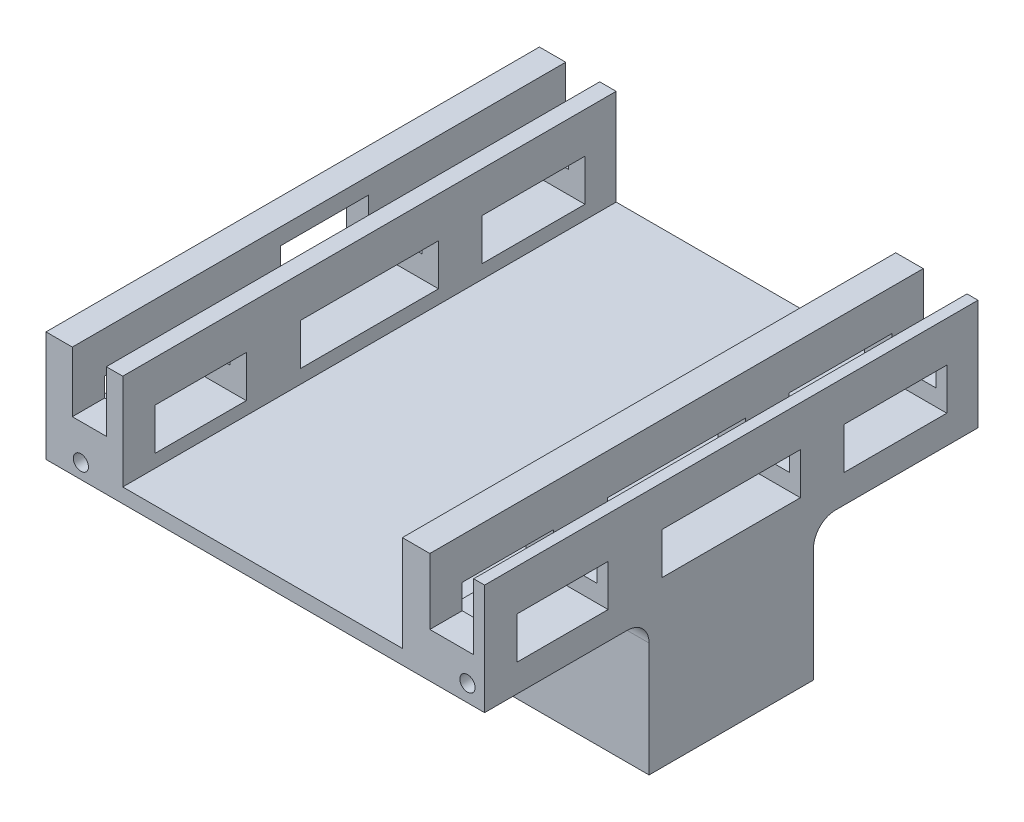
ISO-10303-21;
HEADER;
FILE_DESCRIPTION(('STEP AP214'),'2;1');
FILE_NAME('part.step','',(''),(''),'','','');
FILE_SCHEMA(('AUTOMOTIVE_DESIGN { 1 0 10303 214 1 1 1 1 }'));
ENDSEC;
DATA;
#1=APPLICATION_CONTEXT('core data for automotive mechanical design processes');
#2=APPLICATION_PROTOCOL_DEFINITION('international standard','automotive_design',2000,#1);
#3=PRODUCT_CONTEXT('',#1,'mechanical');
#4=PRODUCT('Part','Part','',(#3));
#5=PRODUCT_RELATED_PRODUCT_CATEGORY('part','',(#4));
#6=PRODUCT_DEFINITION_FORMATION('','',#4);
#7=PRODUCT_DEFINITION_CONTEXT('part definition',#1,'design');
#8=PRODUCT_DEFINITION('design','',#6,#7);
#9=PRODUCT_DEFINITION_SHAPE('','',#8);
#10=(LENGTH_UNIT() NAMED_UNIT(*) SI_UNIT(.MILLI.,.METRE.));
#11=(NAMED_UNIT(*) PLANE_ANGLE_UNIT() SI_UNIT($,.RADIAN.));
#12=(NAMED_UNIT(*) SI_UNIT($,.STERADIAN.) SOLID_ANGLE_UNIT());
#13=UNCERTAINTY_MEASURE_WITH_UNIT(LENGTH_MEASURE(1.E-05),#10,'distance_accuracy_value','');
#14=(GEOMETRIC_REPRESENTATION_CONTEXT(3) GLOBAL_UNCERTAINTY_ASSIGNED_CONTEXT((#13)) GLOBAL_UNIT_ASSIGNED_CONTEXT((#10,
#11,#12)) REPRESENTATION_CONTEXT('',''));
#15=CARTESIAN_POINT('',(0.,0.,0.));
#16=DIRECTION('',(0.,0.,1.));
#17=DIRECTION('',(1.,0.,0.));
#18=AXIS2_PLACEMENT_3D('',#15,#16,#17);
#19=CARTESIAN_POINT('',(0.,20.955,0.));
#20=DIRECTION('',(0.,-1.,0.));
#21=DIRECTION('',(0.,0.,-1.));
#22=AXIS2_PLACEMENT_3D('',#19,#20,#21);
#23=PLANE('',#22);
#24=DIRECTION('',(1.,0.,0.));
#25=VECTOR('',#24,1.);
#26=CARTESIAN_POINT('',(0.,20.955,17.526));
#27=LINE('',#26,#25);
#28=CARTESIAN_POINT('',(44.4585539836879,20.955,17.526));
#29=VERTEX_POINT('',#28);
#30=CARTESIAN_POINT('',(49.53,20.955,17.526));
#31=VERTEX_POINT('',#30);
#32=EDGE_CURVE('E788',#29,#31,#27,.T.);
#33=ORIENTED_EDGE('',*,*,#32,.F.);
#34=DIRECTION('',(0.,0.,1.));
#35=VECTOR('',#34,1.);
#36=CARTESIAN_POINT('',(44.4585539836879,20.955,-30.48));
#37=LINE('',#36,#35);
#38=CARTESIAN_POINT('',(44.4585539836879,20.955,23.7898496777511));
#39=VERTEX_POINT('',#38);
#40=EDGE_CURVE('E582',#29,#39,#37,.T.);
#41=ORIENTED_EDGE('',*,*,#40,.T.);
#42=DIRECTION('',(-1.,0.,0.));
#43=VECTOR('',#42,1.);
#44=CARTESIAN_POINT('',(5.33399999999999,20.955,23.7898496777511));
#45=LINE('',#44,#43);
#46=CARTESIAN_POINT('',(49.53,20.955,23.7898496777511));
#47=VERTEX_POINT('',#46);
#48=EDGE_CURVE('E798',#47,#39,#45,.T.);
#49=ORIENTED_EDGE('',*,*,#48,.F.);
#50=DIRECTION('',(0.,0.,-1.));
#51=VECTOR('',#50,1.);
#52=CARTESIAN_POINT('',(49.53,20.955,-19.05));
#53=LINE('',#52,#51);
#54=EDGE_CURVE('E778',#47,#31,#53,.T.);
#55=ORIENTED_EDGE('',*,*,#54,.T.);
#56=EDGE_LOOP('',(#33,#41,#49,#55));
#57=FACE_BOUND('',#56,.T.);
#58=ADVANCED_FACE('F34',(#57),#23,.F.);
#59=CARTESIAN_POINT('',(44.4585539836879,20.955,-3.52357536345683));
#60=VERTEX_POINT('',#59);
#61=CARTESIAN_POINT('',(44.4585539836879,20.955,1.524));
#62=VERTEX_POINT('',#61);
#63=EDGE_CURVE('E581',#60,#62,#37,.T.);
#64=ORIENTED_EDGE('',*,*,#63,.T.);
#65=DIRECTION('',(-1.,0.,0.));
#66=VECTOR('',#65,1.);
#67=CARTESIAN_POINT('',(0.,20.955,1.524));
#68=LINE('',#67,#66);
#69=CARTESIAN_POINT('',(49.53,20.955,1.52399999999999));
#70=VERTEX_POINT('',#69);
#71=EDGE_CURVE('E1043',#70,#62,#68,.T.);
#72=ORIENTED_EDGE('',*,*,#71,.F.);
#73=CARTESIAN_POINT('',(49.53,20.955,-3.52357536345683));
#74=VERTEX_POINT('',#73);
#75=EDGE_CURVE('E1409',#70,#74,#53,.T.);
#76=ORIENTED_EDGE('',*,*,#75,.T.);
#77=DIRECTION('',(1.,0.,0.));
#78=VECTOR('',#77,1.);
#79=CARTESIAN_POINT('',(45.466,20.955,-3.52357536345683));
#80=LINE('',#79,#78);
#81=EDGE_CURVE('E793',#60,#74,#80,.T.);
#82=ORIENTED_EDGE('',*,*,#81,.F.);
#83=EDGE_LOOP('',(#64,#72,#76,#82));
#84=FACE_BOUND('',#83,.T.);
#85=ADVANCED_FACE('F1168',(#84),#23,.F.);
#86=DIRECTION('',(1.,0.,0.));
#87=VECTOR('',#86,1.);
#88=CARTESIAN_POINT('',(5.33399999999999,20.955,34.3528770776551));
#89=LINE('',#88,#87);
#90=CARTESIAN_POINT('',(44.4585539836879,20.955,34.3528770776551));
#91=VERTEX_POINT('',#90);
#92=CARTESIAN_POINT('',(49.53,20.955,34.3528770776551));
#93=VERTEX_POINT('',#92);
#94=EDGE_CURVE('E801',#91,#93,#89,.T.);
#95=ORIENTED_EDGE('',*,*,#94,.F.);
#96=CARTESIAN_POINT('',(44.4585539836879,20.955,38.1));
#97=VERTEX_POINT('',#96);
#98=EDGE_CURVE('E583',#91,#97,#37,.T.);
#99=ORIENTED_EDGE('',*,*,#98,.T.);
#100=DIRECTION('',(1.,0.,0.));
#101=VECTOR('',#100,1.);
#102=CARTESIAN_POINT('',(49.53,20.955,38.1));
#103=LINE('',#102,#101);
#104=CARTESIAN_POINT('',(49.53,20.955,38.1));
#105=VERTEX_POINT('',#104);
#106=EDGE_CURVE('E781',#97,#105,#103,.T.);
#107=ORIENTED_EDGE('',*,*,#106,.T.);
#108=EDGE_CURVE('E774',#105,#93,#53,.T.);
#109=ORIENTED_EDGE('',*,*,#108,.T.);
#110=EDGE_LOOP('',(#95,#99,#107,#109));
#111=FACE_BOUND('',#110,.T.);
#112=ADVANCED_FACE('F1175',(#111),#23,.F.);
#113=CARTESIAN_POINT('',(0.,17.4625,0.));
#114=DIRECTION('',(0.,1.,0.));
#115=DIRECTION('',(0.,0.,1.));
#116=AXIS2_PLACEMENT_3D('',#113,#114,#115);
#117=PLANE('',#116);
#118=DIRECTION('',(1.,0.,0.));
#119=VECTOR('',#118,1.);
#120=CARTESIAN_POINT('',(46.99,17.4625,38.1));
#121=LINE('',#120,#119);
#122=CARTESIAN_POINT('',(8.89,17.4625,38.1));
#123=VERTEX_POINT('',#122);
#124=CARTESIAN_POINT('',(41.275,17.4625,38.1));
#125=VERTEX_POINT('',#124);
#126=EDGE_CURVE('E833',#123,#125,#121,.T.);
#127=ORIENTED_EDGE('',*,*,#126,.T.);
#128=DIRECTION('',(0.,0.,1.));
#129=VECTOR('',#128,1.);
#130=CARTESIAN_POINT('',(41.275,17.4625,-30.48));
#131=LINE('',#130,#129);
#132=CARTESIAN_POINT('',(41.275,17.4625,-19.05));
#133=VERTEX_POINT('',#132);
#134=EDGE_CURVE('E589',#133,#125,#131,.T.);
#135=ORIENTED_EDGE('',*,*,#134,.F.);
#136=DIRECTION('',(-1.,0.,0.));
#137=VECTOR('',#136,1.);
#138=CARTESIAN_POINT('',(46.99,17.4625,-19.05));
#139=LINE('',#138,#137);
#140=CARTESIAN_POINT('',(8.89,17.4625,-19.05));
#141=VERTEX_POINT('',#140);
#142=EDGE_CURVE('E829',#133,#141,#139,.T.);
#143=ORIENTED_EDGE('',*,*,#142,.T.);
#144=DIRECTION('',(0.,0.,1.));
#145=VECTOR('',#144,1.);
#146=CARTESIAN_POINT('',(8.89,17.4625,38.1));
#147=LINE('',#146,#145);
#148=EDGE_CURVE('E831',#141,#123,#147,.T.);
#149=ORIENTED_EDGE('',*,*,#148,.T.);
#150=EDGE_LOOP('',(#127,#135,#143,#149));
#151=FACE_BOUND('',#150,.T.);
#152=ADVANCED_FACE('F1192',(#151),#117,.T.);
#153=CARTESIAN_POINT('',(0.,19.05,17.526));
#154=DIRECTION('',(0.,-1.,0.));
#155=DIRECTION('',(0.,0.,-1.));
#156=AXIS2_PLACEMENT_3D('',#153,#154,#155);
#157=PLANE('',#156);
#158=DIRECTION('',(0.,0.,1.));
#159=VECTOR('',#158,1.);
#160=CARTESIAN_POINT('',(3.048,19.05,1.524));
#161=LINE('',#160,#159);
#162=CARTESIAN_POINT('',(3.048,19.05,1.524));
#163=VERTEX_POINT('',#162);
#164=CARTESIAN_POINT('',(3.048,19.05,17.526));
#165=VERTEX_POINT('',#164);
#166=EDGE_CURVE('E679',#163,#165,#161,.T.);
#167=ORIENTED_EDGE('',*,*,#166,.T.);
#168=DIRECTION('',(1.,0.,0.));
#169=VECTOR('',#168,1.);
#170=CARTESIAN_POINT('',(0.,19.05,17.526));
#171=LINE('',#170,#169);
#172=CARTESIAN_POINT('',(8.89,19.05,17.526));
#173=VERTEX_POINT('',#172);
#174=EDGE_CURVE('E884',#165,#173,#171,.T.);
#175=ORIENTED_EDGE('',*,*,#174,.T.);
#176=DIRECTION('',(0.,0.,-1.));
#177=VECTOR('',#176,1.);
#178=CARTESIAN_POINT('',(8.89,19.05,17.526));
#179=LINE('',#178,#177);
#180=CARTESIAN_POINT('',(8.89,19.05,1.524));
#181=VERTEX_POINT('',#180);
#182=EDGE_CURVE('E847',#173,#181,#179,.T.);
#183=ORIENTED_EDGE('',*,*,#182,.T.);
#184=DIRECTION('',(1.,0.,0.));
#185=VECTOR('',#184,1.);
#186=CARTESIAN_POINT('',(0.,19.05,1.524));
#187=LINE('',#186,#185);
#188=EDGE_CURVE('E882',#163,#181,#187,.T.);
#189=ORIENTED_EDGE('',*,*,#188,.F.);
#190=EDGE_LOOP('',(#167,#175,#183,#189));
#191=FACE_BOUND('',#190,.T.);
#192=ADVANCED_FACE('F1197',(#191),#157,.F.);
#193=CARTESIAN_POINT('',(0.,19.05,1.524));
#194=DIRECTION('',(0.,0.,-1.));
#195=DIRECTION('',(0.,1.,0.));
#196=AXIS2_PLACEMENT_3D('',#193,#194,#195);
#197=PLANE('',#196);
#198=DIRECTION('',(0.,-1.,0.));
#199=VECTOR('',#198,1.);
#200=CARTESIAN_POINT('',(3.048,23.876,1.524));
#201=LINE('',#200,#199);
#202=CARTESIAN_POINT('',(3.048,21.59,1.52399999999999));
#203=VERTEX_POINT('',#202);
#204=EDGE_CURVE('E669',#203,#163,#201,.T.);
#205=ORIENTED_EDGE('',*,*,#204,.T.);
#206=ORIENTED_EDGE('',*,*,#188,.T.);
#207=DIRECTION('',(0.,1.,0.));
#208=VECTOR('',#207,1.);
#209=CARTESIAN_POINT('',(8.89,19.05,1.524));
#210=LINE('',#209,#208);
#211=CARTESIAN_POINT('',(8.89,23.876,1.524));
#212=VERTEX_POINT('',#211);
#213=EDGE_CURVE('E844',#181,#212,#210,.T.);
#214=ORIENTED_EDGE('',*,*,#213,.T.);
#215=DIRECTION('',(1.,0.,0.));
#216=VECTOR('',#215,1.);
#217=CARTESIAN_POINT('',(0.,23.876,1.524));
#218=LINE('',#217,#216);
#219=CARTESIAN_POINT('',(6.985,23.876,1.524));
#220=VERTEX_POINT('',#219);
#221=EDGE_CURVE('E879',#220,#212,#218,.T.);
#222=ORIENTED_EDGE('',*,*,#221,.F.);
#223=DIRECTION('',(0.,-1.,0.));
#224=VECTOR('',#223,1.);
#225=CARTESIAN_POINT('',(6.985,19.05,1.524));
#226=LINE('',#225,#224);
#227=CARTESIAN_POINT('',(6.985,21.59,1.52399999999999));
#228=VERTEX_POINT('',#227);
#229=EDGE_CURVE('E752',#220,#228,#226,.T.);
#230=ORIENTED_EDGE('',*,*,#229,.T.);
#231=DIRECTION('',(-1.,0.,0.));
#232=VECTOR('',#231,1.);
#233=CARTESIAN_POINT('',(0.,21.59,1.524));
#234=LINE('',#233,#232);
#235=EDGE_CURVE('E734',#228,#203,#234,.T.);
#236=ORIENTED_EDGE('',*,*,#235,.T.);
#237=EDGE_LOOP('',(#205,#206,#214,#222,#230,#236));
#238=FACE_BOUND('',#237,.T.);
#239=ADVANCED_FACE('F1347',(#238),#197,.F.);
#240=CARTESIAN_POINT('',(0.,19.05,17.526));
#241=DIRECTION('',(0.,0.,1.));
#242=DIRECTION('',(1.,0.,0.));
#243=AXIS2_PLACEMENT_3D('',#240,#241,#242);
#244=PLANE('',#243);
#245=DIRECTION('',(0.,1.,0.));
#246=VECTOR('',#245,1.);
#247=CARTESIAN_POINT('',(3.048,23.876,17.526));
#248=LINE('',#247,#246);
#249=CARTESIAN_POINT('',(3.048,21.59,17.526));
#250=VERTEX_POINT('',#249);
#251=EDGE_CURVE('E681',#165,#250,#248,.T.);
#252=ORIENTED_EDGE('',*,*,#251,.T.);
#253=DIRECTION('',(1.,0.,0.));
#254=VECTOR('',#253,1.);
#255=CARTESIAN_POINT('',(0.,21.59,17.526));
#256=LINE('',#255,#254);
#257=CARTESIAN_POINT('',(6.985,21.59,17.526));
#258=VERTEX_POINT('',#257);
#259=EDGE_CURVE('E1048',#250,#258,#256,.T.);
#260=ORIENTED_EDGE('',*,*,#259,.T.);
#261=DIRECTION('',(0.,1.,0.));
#262=VECTOR('',#261,1.);
#263=CARTESIAN_POINT('',(6.985,19.05,17.526));
#264=LINE('',#263,#262);
#265=CARTESIAN_POINT('',(6.985,23.876,17.526));
#266=VERTEX_POINT('',#265);
#267=EDGE_CURVE('E1051',#258,#266,#264,.T.);
#268=ORIENTED_EDGE('',*,*,#267,.T.);
#269=DIRECTION('',(1.,0.,0.));
#270=VECTOR('',#269,1.);
#271=CARTESIAN_POINT('',(0.,23.876,17.526));
#272=LINE('',#271,#270);
#273=CARTESIAN_POINT('',(8.89,23.876,17.526));
#274=VERTEX_POINT('',#273);
#275=EDGE_CURVE('E875',#266,#274,#272,.T.);
#276=ORIENTED_EDGE('',*,*,#275,.T.);
#277=DIRECTION('',(0.,-1.,0.));
#278=VECTOR('',#277,1.);
#279=CARTESIAN_POINT('',(8.89,19.05,17.526));
#280=LINE('',#279,#278);
#281=EDGE_CURVE('E1040',#274,#173,#280,.T.);
#282=ORIENTED_EDGE('',*,*,#281,.T.);
#283=ORIENTED_EDGE('',*,*,#174,.F.);
#284=EDGE_LOOP('',(#252,#260,#268,#276,#282,#283));
#285=FACE_BOUND('',#284,.T.);
#286=ADVANCED_FACE('F1235',(#285),#244,.F.);
#287=CARTESIAN_POINT('',(0.,28.575,0.));
#288=DIRECTION('',(0.,1.,0.));
#289=DIRECTION('',(0.,0.,1.));
#290=AXIS2_PLACEMENT_3D('',#287,#288,#289);
#291=PLANE('',#290);
#292=DIRECTION('',(0.,0.,1.));
#293=VECTOR('',#292,1.);
#294=CARTESIAN_POINT('',(6.985,28.575,-19.05));
#295=LINE('',#294,#293);
#296=CARTESIAN_POINT('',(6.985,28.575,-19.05));
#297=VERTEX_POINT('',#296);
#298=CARTESIAN_POINT('',(6.985,28.575,38.1));
#299=VERTEX_POINT('',#298);
#300=EDGE_CURVE('E695',#297,#299,#295,.T.);
#301=ORIENTED_EDGE('',*,*,#300,.T.);
#302=DIRECTION('',(-1.,0.,0.));
#303=VECTOR('',#302,1.);
#304=CARTESIAN_POINT('',(43.18,28.575,38.1));
#305=LINE('',#304,#303);
#306=CARTESIAN_POINT('',(8.89,28.575,38.1));
#307=VERTEX_POINT('',#306);
#308=EDGE_CURVE('E1009',#307,#299,#305,.T.);
#309=ORIENTED_EDGE('',*,*,#308,.F.);
#310=DIRECTION('',(0.,0.,1.));
#311=VECTOR('',#310,1.);
#312=CARTESIAN_POINT('',(8.89,28.575,38.1));
#313=LINE('',#312,#311);
#314=CARTESIAN_POINT('',(8.89,28.575,-19.05));
#315=VERTEX_POINT('',#314);
#316=EDGE_CURVE('E828',#315,#307,#313,.T.);
#317=ORIENTED_EDGE('',*,*,#316,.F.);
#318=DIRECTION('',(-1.,0.,0.));
#319=VECTOR('',#318,1.);
#320=CARTESIAN_POINT('',(43.18,28.575,-19.05));
#321=LINE('',#320,#319);
#322=EDGE_CURVE('E1017',#315,#297,#321,.T.);
#323=ORIENTED_EDGE('',*,*,#322,.T.);
#324=EDGE_LOOP('',(#301,#309,#317,#323));
#325=FACE_BOUND('',#324,.T.);
#326=ADVANCED_FACE('F1318',(#325),#291,.T.);
#327=CARTESIAN_POINT('',(5.33399999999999,23.8022964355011,34.3528770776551));
#328=DIRECTION('',(0.,1.,0.));
#329=DIRECTION('',(0.,0.,1.));
#330=AXIS2_PLACEMENT_3D('',#327,#328,#329);
#331=PLANE('',#330);
#332=DIRECTION('',(1.,0.,0.));
#333=VECTOR('',#332,1.);
#334=CARTESIAN_POINT('',(5.33399999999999,23.8022964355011,34.3528770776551));
#335=LINE('',#334,#333);
#336=CARTESIAN_POINT('',(6.985,23.8022964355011,34.3528770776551));
#337=VERTEX_POINT('',#336);
#338=CARTESIAN_POINT('',(8.89,23.8022964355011,34.3528770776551));
#339=VERTEX_POINT('',#338);
#340=EDGE_CURVE('E990',#337,#339,#335,.T.);
#341=ORIENTED_EDGE('',*,*,#340,.F.);
#342=DIRECTION('',(0.,0.,-1.));
#343=VECTOR('',#342,1.);
#344=CARTESIAN_POINT('',(6.985,23.8022964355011,34.3528770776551));
#345=LINE('',#344,#343);
#346=CARTESIAN_POINT('',(6.985,23.8022964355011,23.7898496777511));
#347=VERTEX_POINT('',#346);
#348=EDGE_CURVE('E767',#337,#347,#345,.T.);
#349=ORIENTED_EDGE('',*,*,#348,.T.);
#350=DIRECTION('',(1.,0.,0.));
#351=VECTOR('',#350,1.);
#352=CARTESIAN_POINT('',(5.33399999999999,23.8022964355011,23.7898496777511));
#353=LINE('',#352,#351);
#354=CARTESIAN_POINT('',(8.89,23.8022964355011,23.7898496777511));
#355=VERTEX_POINT('',#354);
#356=EDGE_CURVE('E995',#347,#355,#353,.T.);
#357=ORIENTED_EDGE('',*,*,#356,.T.);
#358=DIRECTION('',(0.,0.,1.));
#359=VECTOR('',#358,1.);
#360=CARTESIAN_POINT('',(8.89,23.8022964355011,34.3528770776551));
#361=LINE('',#360,#359);
#362=EDGE_CURVE('E868',#355,#339,#361,.T.);
#363=ORIENTED_EDGE('',*,*,#362,.T.);
#364=EDGE_LOOP('',(#341,#349,#357,#363));
#365=FACE_BOUND('',#364,.T.);
#366=ADVANCED_FACE('F1275',(#365),#331,.F.);
#367=CARTESIAN_POINT('',(45.466,23.876,-15.4355961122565));
#368=DIRECTION('',(0.,1.,0.));
#369=DIRECTION('',(0.,0.,1.));
#370=AXIS2_PLACEMENT_3D('',#367,#368,#369);
#371=PLANE('',#370);
#372=DIRECTION('',(-1.,0.,0.));
#373=VECTOR('',#372,1.);
#374=CARTESIAN_POINT('',(45.466,23.876,-3.52357536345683));
#375=LINE('',#374,#373);
#376=CARTESIAN_POINT('',(8.89,23.876,-3.52357536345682));
#377=VERTEX_POINT('',#376);
#378=CARTESIAN_POINT('',(6.985,23.876,-3.52357536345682));
#379=VERTEX_POINT('',#378);
#380=EDGE_CURVE('E980',#377,#379,#375,.T.);
#381=ORIENTED_EDGE('',*,*,#380,.T.);
#382=DIRECTION('',(0.,0.,-1.));
#383=VECTOR('',#382,1.);
#384=CARTESIAN_POINT('',(6.985,23.876,-15.4355961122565));
#385=LINE('',#384,#383);
#386=CARTESIAN_POINT('',(6.985,23.876,-15.4355961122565));
#387=VERTEX_POINT('',#386);
#388=EDGE_CURVE('E758',#379,#387,#385,.T.);
#389=ORIENTED_EDGE('',*,*,#388,.T.);
#390=DIRECTION('',(-1.,0.,0.));
#391=VECTOR('',#390,1.);
#392=CARTESIAN_POINT('',(45.466,23.876,-15.4355961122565));
#393=LINE('',#392,#391);
#394=CARTESIAN_POINT('',(8.89,23.876,-15.4355961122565));
#395=VERTEX_POINT('',#394);
#396=EDGE_CURVE('E975',#395,#387,#393,.T.);
#397=ORIENTED_EDGE('',*,*,#396,.F.);
#398=DIRECTION('',(0.,0.,1.));
#399=VECTOR('',#398,1.);
#400=CARTESIAN_POINT('',(8.89,23.876,-15.4355961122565));
#401=LINE('',#400,#399);
#402=EDGE_CURVE('E856',#395,#377,#401,.T.);
#403=ORIENTED_EDGE('',*,*,#402,.T.);
#404=EDGE_LOOP('',(#381,#389,#397,#403));
#405=FACE_BOUND('',#404,.T.);
#406=ADVANCED_FACE('F1250',(#405),#371,.F.);
#407=CARTESIAN_POINT('',(0.,23.876,17.526));
#408=DIRECTION('',(0.,1.,0.));
#409=DIRECTION('',(0.,0.,1.));
#410=AXIS2_PLACEMENT_3D('',#407,#408,#409);
#411=PLANE('',#410);
#412=ORIENTED_EDGE('',*,*,#275,.F.);
#413=DIRECTION('',(0.,0.,-1.));
#414=VECTOR('',#413,1.);
#415=CARTESIAN_POINT('',(6.985,23.876,17.526));
#416=LINE('',#415,#414);
#417=EDGE_CURVE('E749',#266,#220,#416,.T.);
#418=ORIENTED_EDGE('',*,*,#417,.T.);
#419=ORIENTED_EDGE('',*,*,#221,.T.);
#420=DIRECTION('',(0.,0.,1.));
#421=VECTOR('',#420,1.);
#422=CARTESIAN_POINT('',(8.89,23.876,17.526));
#423=LINE('',#422,#421);
#424=EDGE_CURVE('E840',#212,#274,#423,.T.);
#425=ORIENTED_EDGE('',*,*,#424,.T.);
#426=EDGE_LOOP('',(#412,#418,#419,#425));
#427=FACE_BOUND('',#426,.T.);
#428=ADVANCED_FACE('F1329',(#427),#411,.F.);
#429=DIRECTION('',(0.,0.,-1.));
#430=VECTOR('',#429,1.);
#431=CARTESIAN_POINT('',(49.53,28.575,-19.05));
#432=LINE('',#431,#430);
#433=CARTESIAN_POINT('',(49.53,28.575,38.1));
#434=VERTEX_POINT('',#433);
#435=CARTESIAN_POINT('',(49.53,28.575,-19.05));
#436=VERTEX_POINT('',#435);
#437=EDGE_CURVE('E773',#434,#436,#432,.T.);
#438=ORIENTED_EDGE('',*,*,#437,.F.);
#439=CARTESIAN_POINT('',(50.8,28.575,38.1));
#440=VERTEX_POINT('',#439);
#441=EDGE_CURVE('E1004',#440,#434,#305,.T.);
#442=ORIENTED_EDGE('',*,*,#441,.F.);
#443=DIRECTION('',(0.,0.,1.));
#444=VECTOR('',#443,1.);
#445=CARTESIAN_POINT('',(50.8,28.575,38.1));
#446=LINE('',#445,#444);
#447=CARTESIAN_POINT('',(50.8,28.575,-19.05));
#448=VERTEX_POINT('',#447);
#449=EDGE_CURVE('E967',#448,#440,#446,.T.);
#450=ORIENTED_EDGE('',*,*,#449,.F.);
#451=EDGE_CURVE('E1012',#448,#436,#321,.T.);
#452=ORIENTED_EDGE('',*,*,#451,.T.);
#453=EDGE_LOOP('',(#438,#442,#450,#452));
#454=FACE_BOUND('',#453,.T.);
#455=ADVANCED_FACE('F1321',(#454),#291,.T.);
#456=CARTESIAN_POINT('',(49.53,23.8022964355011,34.3528770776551));
#457=VERTEX_POINT('',#456);
#458=CARTESIAN_POINT('',(50.8,23.8022964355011,34.3528770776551));
#459=VERTEX_POINT('',#458);
#460=EDGE_CURVE('E991',#457,#459,#335,.T.);
#461=ORIENTED_EDGE('',*,*,#460,.F.);
#462=DIRECTION('',(0.,0.,-1.));
#463=VECTOR('',#462,1.);
#464=CARTESIAN_POINT('',(49.53,23.8022964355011,34.3528770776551));
#465=LINE('',#464,#463);
#466=CARTESIAN_POINT('',(49.53,23.8022964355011,23.7898496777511));
#467=VERTEX_POINT('',#466);
#468=EDGE_CURVE('E822',#457,#467,#465,.T.);
#469=ORIENTED_EDGE('',*,*,#468,.T.);
#470=CARTESIAN_POINT('',(50.8,23.8022964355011,23.7898496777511));
#471=VERTEX_POINT('',#470);
#472=EDGE_CURVE('E996',#467,#471,#353,.T.);
#473=ORIENTED_EDGE('',*,*,#472,.T.);
#474=DIRECTION('',(0.,0.,1.));
#475=VECTOR('',#474,1.);
#476=CARTESIAN_POINT('',(50.8,23.8022964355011,34.3528770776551));
#477=LINE('',#476,#475);
#478=EDGE_CURVE('E954',#471,#459,#477,.T.);
#479=ORIENTED_EDGE('',*,*,#478,.T.);
#480=EDGE_LOOP('',(#461,#469,#473,#479));
#481=FACE_BOUND('',#480,.T.);
#482=ADVANCED_FACE('F1279',(#481),#331,.F.);
#483=CARTESIAN_POINT('',(50.8,23.876,-3.52357536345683));
#484=VERTEX_POINT('',#483);
#485=CARTESIAN_POINT('',(49.53,23.876,-3.52357536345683));
#486=VERTEX_POINT('',#485);
#487=EDGE_CURVE('E977',#484,#486,#375,.T.);
#488=ORIENTED_EDGE('',*,*,#487,.T.);
#489=DIRECTION('',(0.,0.,-1.));
#490=VECTOR('',#489,1.);
#491=CARTESIAN_POINT('',(49.53,23.876,-15.4355961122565));
#492=LINE('',#491,#490);
#493=CARTESIAN_POINT('',(49.53,23.876,-15.4355961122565));
#494=VERTEX_POINT('',#493);
#495=EDGE_CURVE('E813',#486,#494,#492,.T.);
#496=ORIENTED_EDGE('',*,*,#495,.T.);
#497=CARTESIAN_POINT('',(50.8,23.876,-15.4355961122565));
#498=VERTEX_POINT('',#497);
#499=EDGE_CURVE('E971',#498,#494,#393,.T.);
#500=ORIENTED_EDGE('',*,*,#499,.F.);
#501=DIRECTION('',(0.,0.,1.));
#502=VECTOR('',#501,1.);
#503=CARTESIAN_POINT('',(50.8,23.876,-3.52357536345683));
#504=LINE('',#503,#502);
#505=EDGE_CURVE('E942',#498,#484,#504,.T.);
#506=ORIENTED_EDGE('',*,*,#505,.T.);
#507=EDGE_LOOP('',(#488,#496,#500,#506));
#508=FACE_BOUND('',#507,.T.);
#509=ADVANCED_FACE('F1320',(#508),#371,.F.);
#510=CARTESIAN_POINT('',(49.53,23.876,17.526));
#511=VERTEX_POINT('',#510);
#512=CARTESIAN_POINT('',(50.8,23.876,17.526));
#513=VERTEX_POINT('',#512);
#514=EDGE_CURVE('E878',#511,#513,#272,.T.);
#515=ORIENTED_EDGE('',*,*,#514,.F.);
#516=DIRECTION('',(0.,0.,-1.));
#517=VECTOR('',#516,1.);
#518=CARTESIAN_POINT('',(49.53,23.876,17.526));
#519=LINE('',#518,#517);
#520=CARTESIAN_POINT('',(49.53,23.876,1.524));
#521=VERTEX_POINT('',#520);
#522=EDGE_CURVE('E804',#511,#521,#519,.T.);
#523=ORIENTED_EDGE('',*,*,#522,.T.);
#524=CARTESIAN_POINT('',(50.8,23.876,1.524));
#525=VERTEX_POINT('',#524);
#526=EDGE_CURVE('E881',#521,#525,#218,.T.);
#527=ORIENTED_EDGE('',*,*,#526,.T.);
#528=DIRECTION('',(0.,0.,-1.));
#529=VECTOR('',#528,1.);
#530=CARTESIAN_POINT('',(50.8,23.876,19.05));
#531=LINE('',#530,#529);
#532=EDGE_CURVE('E891',#513,#525,#531,.T.);
#533=ORIENTED_EDGE('',*,*,#532,.F.);
#534=EDGE_LOOP('',(#515,#523,#527,#533));
#535=FACE_BOUND('',#534,.T.);
#536=ADVANCED_FACE('F1326',(#535),#411,.F.);
#537=DIRECTION('',(0.,0.,1.));
#538=VECTOR('',#537,1.);
#539=CARTESIAN_POINT('',(44.4585539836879,28.575,-30.48));
#540=LINE('',#539,#538);
#541=CARTESIAN_POINT('',(44.4585539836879,28.575,-19.05));
#542=VERTEX_POINT('',#541);
#543=CARTESIAN_POINT('',(44.4585539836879,28.575,38.1));
#544=VERTEX_POINT('',#543);
#545=EDGE_CURVE('E576',#542,#544,#540,.T.);
#546=ORIENTED_EDGE('',*,*,#545,.F.);
#547=CARTESIAN_POINT('',(41.275,28.575,-19.05));
#548=VERTEX_POINT('',#547);
#549=EDGE_CURVE('E1016',#542,#548,#321,.T.);
#550=ORIENTED_EDGE('',*,*,#549,.T.);
#551=DIRECTION('',(0.,0.,1.));
#552=VECTOR('',#551,1.);
#553=CARTESIAN_POINT('',(41.275,28.575,-30.48));
#554=LINE('',#553,#552);
#555=CARTESIAN_POINT('',(41.275,28.575,38.1));
#556=VERTEX_POINT('',#555);
#557=EDGE_CURVE('E590',#548,#556,#554,.T.);
#558=ORIENTED_EDGE('',*,*,#557,.T.);
#559=EDGE_CURVE('E1008',#544,#556,#305,.T.);
#560=ORIENTED_EDGE('',*,*,#559,.F.);
#561=EDGE_LOOP('',(#546,#550,#558,#560));
#562=FACE_BOUND('',#561,.T.);
#563=ADVANCED_FACE('F1161',(#562),#291,.T.);
#564=CARTESIAN_POINT('',(0.,0.,19.05));
#565=DIRECTION('',(0.,0.,-1.));
#566=DIRECTION('',(-1.,0.,0.));
#567=AXIS2_PLACEMENT_3D('',#564,#565,#566);
#568=PLANE('',#567);
#569=DIRECTION('',(0.,1.,0.));
#570=VECTOR('',#569,1.);
#571=CARTESIAN_POINT('',(50.8,0.,19.05));
#572=LINE('',#571,#570);
#573=CARTESIAN_POINT('',(50.8,0.,19.05));
#574=VERTEX_POINT('',#573);
#575=CARTESIAN_POINT('',(50.8,13.2366494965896,19.05));
#576=VERTEX_POINT('',#575);
#577=EDGE_CURVE('E1026',#574,#576,#572,.T.);
#578=ORIENTED_EDGE('',*,*,#577,.T.);
#579=DIRECTION('',(-1.,0.,0.));
#580=VECTOR('',#579,1.);
#581=CARTESIAN_POINT('',(0.,13.2366494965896,19.05));
#582=LINE('',#581,#580);
#583=CARTESIAN_POINT('',(0.,13.2366494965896,19.05));
#584=VERTEX_POINT('',#583);
#585=EDGE_CURVE('E1075',#576,#584,#582,.T.);
#586=ORIENTED_EDGE('',*,*,#585,.T.);
#587=DIRECTION('',(0.,-1.,0.));
#588=VECTOR('',#587,1.);
#589=CARTESIAN_POINT('',(0.,0.,19.05));
#590=LINE('',#589,#588);
#591=CARTESIAN_POINT('',(0.,0.,19.05));
#592=VERTEX_POINT('',#591);
#593=EDGE_CURVE('E1021',#584,#592,#590,.T.);
#594=ORIENTED_EDGE('',*,*,#593,.T.);
#595=DIRECTION('',(1.,0.,0.));
#596=VECTOR('',#595,1.);
#597=CARTESIAN_POINT('',(0.,0.,19.05));
#598=LINE('',#597,#596);
#599=EDGE_CURVE('E1023',#592,#574,#598,.T.);
#600=ORIENTED_EDGE('',*,*,#599,.T.);
#601=EDGE_LOOP('',(#578,#586,#594,#600));
#602=FACE_BOUND('',#601,.T.);
#603=CARTESIAN_POINT('',(38.1,9.525,19.05));
#604=DIRECTION('',(0.,0.,-1.));
#605=DIRECTION('',(-1.,0.,0.));
#606=AXIS2_PLACEMENT_3D('',#603,#604,#605);
#607=CIRCLE('',#606,3.302);
#608=CARTESIAN_POINT('',(34.798,9.525,19.05));
#609=VERTEX_POINT('',#608);
#610=EDGE_CURVE('E537',#609,#609,#607,.T.);
#611=ORIENTED_EDGE('',*,*,#610,.T.);
#612=EDGE_LOOP('',(#611));
#613=FACE_BOUND('',#612,.T.);
#614=CARTESIAN_POINT('',(12.7,9.525,19.05));
#615=DIRECTION('',(0.,0.,-1.));
#616=DIRECTION('',(-1.,0.,0.));
#617=AXIS2_PLACEMENT_3D('',#614,#615,#616);
#618=CIRCLE('',#617,3.302);
#619=CARTESIAN_POINT('',(9.398,9.525,19.05));
#620=VERTEX_POINT('',#619);
#621=EDGE_CURVE('E1130',#620,#620,#618,.T.);
#622=ORIENTED_EDGE('',*,*,#621,.T.);
#623=EDGE_LOOP('',(#622));
#624=FACE_BOUND('',#623,.T.);
#625=ADVANCED_FACE('F1139',(#602,#613,#624),#568,.F.);
#626=CARTESIAN_POINT('',(0.,0.,0.));
#627=DIRECTION('',(0.,0.,-1.));
#628=DIRECTION('',(-1.,0.,0.));
#629=AXIS2_PLACEMENT_3D('',#626,#627,#628);
#630=PLANE('',#629);
#631=DIRECTION('',(0.,-1.,0.));
#632=VECTOR('',#631,1.);
#633=CARTESIAN_POINT('',(0.,0.,0.));
#634=LINE('',#633,#632);
#635=CARTESIAN_POINT('',(0.,13.2366494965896,0.));
#636=VERTEX_POINT('',#635);
#637=CARTESIAN_POINT('',(0.,0.,0.));
#638=VERTEX_POINT('',#637);
#639=EDGE_CURVE('E1020',#636,#638,#634,.T.);
#640=ORIENTED_EDGE('',*,*,#639,.F.);
#641=DIRECTION('',(-1.,0.,0.));
#642=VECTOR('',#641,1.);
#643=CARTESIAN_POINT('',(50.8,13.2366494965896,0.));
#644=LINE('',#643,#642);
#645=CARTESIAN_POINT('',(50.8,13.2366494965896,0.));
#646=VERTEX_POINT('',#645);
#647=EDGE_CURVE('E1069',#636,#646,#644,.F.);
#648=ORIENTED_EDGE('',*,*,#647,.T.);
#649=DIRECTION('',(0.,1.,0.));
#650=VECTOR('',#649,1.);
#651=CARTESIAN_POINT('',(50.8,0.,0.));
#652=LINE('',#651,#650);
#653=CARTESIAN_POINT('',(50.8,0.,0.));
#654=VERTEX_POINT('',#653);
#655=EDGE_CURVE('E1024',#654,#646,#652,.T.);
#656=ORIENTED_EDGE('',*,*,#655,.F.);
#657=DIRECTION('',(1.,0.,0.));
#658=VECTOR('',#657,1.);
#659=CARTESIAN_POINT('',(0.,0.,0.));
#660=LINE('',#659,#658);
#661=EDGE_CURVE('E1031',#638,#654,#660,.T.);
#662=ORIENTED_EDGE('',*,*,#661,.F.);
#663=EDGE_LOOP('',(#640,#648,#656,#662));
#664=FACE_BOUND('',#663,.T.);
#665=CARTESIAN_POINT('',(38.1,9.525,0.));
#666=DIRECTION('',(0.,0.,-1.));
#667=DIRECTION('',(-1.,0.,0.));
#668=AXIS2_PLACEMENT_3D('',#665,#666,#667);
#669=CIRCLE('',#668,3.302);
#670=CARTESIAN_POINT('',(34.798,9.525,0.));
#671=VERTEX_POINT('',#670);
#672=EDGE_CURVE('E1127',#671,#671,#669,.T.);
#673=ORIENTED_EDGE('',*,*,#672,.F.);
#674=EDGE_LOOP('',(#673));
#675=FACE_BOUND('',#674,.T.);
#676=CARTESIAN_POINT('',(12.7,9.525,0.));
#677=DIRECTION('',(0.,0.,-1.));
#678=DIRECTION('',(-1.,0.,0.));
#679=AXIS2_PLACEMENT_3D('',#676,#677,#678);
#680=CIRCLE('',#679,3.302);
#681=CARTESIAN_POINT('',(9.398,9.525,0.));
#682=VERTEX_POINT('',#681);
#683=EDGE_CURVE('E1133',#682,#682,#680,.T.);
#684=ORIENTED_EDGE('',*,*,#683,.F.);
#685=EDGE_LOOP('',(#684));
#686=FACE_BOUND('',#685,.T.);
#687=ADVANCED_FACE('F1148',(#664,#675,#686),#630,.T.);
#688=CARTESIAN_POINT('',(5.33399999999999,18.9650826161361,34.3528770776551));
#689=DIRECTION('',(0.,0.,1.));
#690=DIRECTION('',(1.,0.,0.));
#691=AXIS2_PLACEMENT_3D('',#688,#689,#690);
#692=PLANE('',#691);
#693=DIRECTION('',(1.,0.,0.));
#694=VECTOR('',#693,1.);
#695=CARTESIAN_POINT('',(5.33399999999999,18.9650826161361,34.3528770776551));
#696=LINE('',#695,#694);
#697=CARTESIAN_POINT('',(41.275,18.9650826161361,34.3528770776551));
#698=VERTEX_POINT('',#697);
#699=CARTESIAN_POINT('',(50.8,18.9650826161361,34.3528770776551));
#700=VERTEX_POINT('',#699);
#701=EDGE_CURVE('E974',#698,#700,#696,.T.);
#702=ORIENTED_EDGE('',*,*,#701,.F.);
#703=DIRECTION('',(0.,-1.,0.));
#704=VECTOR('',#703,1.);
#705=CARTESIAN_POINT('',(41.275,17.4625,34.3528770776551));
#706=LINE('',#705,#704);
#707=CARTESIAN_POINT('',(41.275,23.8022964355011,34.3528770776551));
#708=VERTEX_POINT('',#707);
#709=EDGE_CURVE('E570',#708,#698,#706,.T.);
#710=ORIENTED_EDGE('',*,*,#709,.F.);
#711=DIRECTION('',(1.,0.,0.));
#712=VECTOR('',#711,1.);
#713=CARTESIAN_POINT('',(38.1,23.8022964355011,34.3528770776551));
#714=LINE('',#713,#712);
#715=CARTESIAN_POINT('',(44.4585539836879,23.8022964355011,34.3528770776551));
#716=VERTEX_POINT('',#715);
#717=EDGE_CURVE('E559',#708,#716,#714,.T.);
#718=ORIENTED_EDGE('',*,*,#717,.T.);
#719=DIRECTION('',(0.,1.,0.));
#720=VECTOR('',#719,1.);
#721=CARTESIAN_POINT('',(44.4585539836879,28.575,34.3528770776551));
#722=LINE('',#721,#720);
#723=EDGE_CURVE('E1090',#91,#716,#722,.T.);
#724=ORIENTED_EDGE('',*,*,#723,.F.);
#725=ORIENTED_EDGE('',*,*,#94,.T.);
#726=DIRECTION('',(0.,1.,0.));
#727=VECTOR('',#726,1.);
#728=CARTESIAN_POINT('',(49.53,18.9650826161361,34.3528770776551));
#729=LINE('',#728,#727);
#730=EDGE_CURVE('E825',#93,#457,#729,.T.);
#731=ORIENTED_EDGE('',*,*,#730,.T.);
#732=ORIENTED_EDGE('',*,*,#460,.T.);
#733=DIRECTION('',(0.,-1.,0.));
#734=VECTOR('',#733,1.);
#735=CARTESIAN_POINT('',(50.8,23.8022964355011,34.3528770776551));
#736=LINE('',#735,#734);
#737=EDGE_CURVE('E945',#459,#700,#736,.T.);
#738=ORIENTED_EDGE('',*,*,#737,.T.);
#739=EDGE_LOOP('',(#702,#710,#718,#724,#725,#731,#732,#738));
#740=FACE_BOUND('',#739,.T.);
#741=ADVANCED_FACE('F1150',(#740),#692,.F.);
#742=CARTESIAN_POINT('',(5.33399999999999,18.9650826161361,23.7898496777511));
#743=DIRECTION('',(0.,0.,-1.));
#744=DIRECTION('',(-1.,0.,0.));
#745=AXIS2_PLACEMENT_3D('',#742,#743,#744);
#746=PLANE('',#745);
#747=ORIENTED_EDGE('',*,*,#48,.T.);
#748=DIRECTION('',(0.,-1.,0.));
#749=VECTOR('',#748,1.);
#750=CARTESIAN_POINT('',(44.4585539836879,28.575,23.7898496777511));
#751=LINE('',#750,#749);
#752=CARTESIAN_POINT('',(44.4585539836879,23.8022964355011,23.7898496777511));
#753=VERTEX_POINT('',#752);
#754=EDGE_CURVE('E1084',#753,#39,#751,.T.);
#755=ORIENTED_EDGE('',*,*,#754,.F.);
#756=DIRECTION('',(1.,0.,0.));
#757=VECTOR('',#756,1.);
#758=CARTESIAN_POINT('',(38.1,23.8022964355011,23.7898496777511));
#759=LINE('',#758,#757);
#760=CARTESIAN_POINT('',(41.275,23.8022964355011,23.7898496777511));
#761=VERTEX_POINT('',#760);
#762=EDGE_CURVE('E558',#761,#753,#759,.T.);
#763=ORIENTED_EDGE('',*,*,#762,.F.);
#764=DIRECTION('',(0.,1.,0.));
#765=VECTOR('',#764,1.);
#766=CARTESIAN_POINT('',(41.275,17.4625,23.7898496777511));
#767=LINE('',#766,#765);
#768=CARTESIAN_POINT('',(41.275,18.9650826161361,23.7898496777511));
#769=VERTEX_POINT('',#768);
#770=EDGE_CURVE('E562',#769,#761,#767,.T.);
#771=ORIENTED_EDGE('',*,*,#770,.F.);
#772=DIRECTION('',(1.,0.,0.));
#773=VECTOR('',#772,1.);
#774=CARTESIAN_POINT('',(5.33399999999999,18.9650826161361,23.7898496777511));
#775=LINE('',#774,#773);
#776=CARTESIAN_POINT('',(50.8,18.9650826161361,23.7898496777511));
#777=VERTEX_POINT('',#776);
#778=EDGE_CURVE('E1000',#769,#777,#775,.T.);
#779=ORIENTED_EDGE('',*,*,#778,.T.);
#780=DIRECTION('',(0.,1.,0.));
#781=VECTOR('',#780,1.);
#782=CARTESIAN_POINT('',(50.8,23.8022964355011,23.7898496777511));
#783=LINE('',#782,#781);
#784=EDGE_CURVE('E951',#777,#471,#783,.T.);
#785=ORIENTED_EDGE('',*,*,#784,.T.);
#786=ORIENTED_EDGE('',*,*,#472,.F.);
#787=DIRECTION('',(0.,-1.,0.));
#788=VECTOR('',#787,1.);
#789=CARTESIAN_POINT('',(49.53,18.9650826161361,23.7898496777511));
#790=LINE('',#789,#788);
#791=EDGE_CURVE('E819',#467,#47,#790,.T.);
#792=ORIENTED_EDGE('',*,*,#791,.T.);
#793=EDGE_LOOP('',(#747,#755,#763,#771,#779,#785,#786,#792));
#794=FACE_BOUND('',#793,.T.);
#795=ADVANCED_FACE('F1157',(#794),#746,.F.);
#796=CARTESIAN_POINT('',(5.33399999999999,18.9650826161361,34.3528770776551));
#797=DIRECTION('',(0.,-1.,0.));
#798=DIRECTION('',(0.,0.,-1.));
#799=AXIS2_PLACEMENT_3D('',#796,#797,#798);
#800=PLANE('',#799);
#801=ORIENTED_EDGE('',*,*,#778,.F.);
#802=DIRECTION('',(0.,0.,-1.));
#803=VECTOR('',#802,1.);
#804=CARTESIAN_POINT('',(41.275,18.9650826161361,-30.48));
#805=LINE('',#804,#803);
#806=EDGE_CURVE('E1093',#698,#769,#805,.T.);
#807=ORIENTED_EDGE('',*,*,#806,.F.);
#808=ORIENTED_EDGE('',*,*,#701,.T.);
#809=DIRECTION('',(0.,0.,-1.));
#810=VECTOR('',#809,1.);
#811=CARTESIAN_POINT('',(50.8,18.9650826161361,34.3528770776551));
#812=LINE('',#811,#810);
#813=EDGE_CURVE('E948',#700,#777,#812,.T.);
#814=ORIENTED_EDGE('',*,*,#813,.T.);
#815=EDGE_LOOP('',(#801,#807,#808,#814));
#816=FACE_BOUND('',#815,.T.);
#817=ADVANCED_FACE('F1296',(#816),#800,.F.);
#818=CARTESIAN_POINT('',(45.466,19.05,-15.4355961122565));
#819=DIRECTION('',(0.,0.,-1.));
#820=DIRECTION('',(-1.,0.,0.));
#821=AXIS2_PLACEMENT_3D('',#818,#819,#820);
#822=PLANE('',#821);
#823=DIRECTION('',(-1.,0.,0.));
#824=VECTOR('',#823,1.);
#825=CARTESIAN_POINT('',(45.466,20.955,-15.4355961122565));
#826=LINE('',#825,#824);
#827=CARTESIAN_POINT('',(49.53,20.955,-15.4355961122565));
#828=VERTEX_POINT('',#827);
#829=CARTESIAN_POINT('',(44.4585539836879,20.955,-15.4355961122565));
#830=VERTEX_POINT('',#829);
#831=EDGE_CURVE('E796',#828,#830,#826,.T.);
#832=ORIENTED_EDGE('',*,*,#831,.T.);
#833=DIRECTION('',(0.,-1.,0.));
#834=VECTOR('',#833,1.);
#835=CARTESIAN_POINT('',(44.4585539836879,28.575,-15.4355961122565));
#836=LINE('',#835,#834);
#837=CARTESIAN_POINT('',(44.4585539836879,23.876,-15.4355961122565));
#838=VERTEX_POINT('',#837);
#839=EDGE_CURVE('E536',#838,#830,#836,.T.);
#840=ORIENTED_EDGE('',*,*,#839,.F.);
#841=DIRECTION('',(1.,0.,0.));
#842=VECTOR('',#841,1.);
#843=CARTESIAN_POINT('',(38.1,23.876,-15.4355961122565));
#844=LINE('',#843,#842);
#845=CARTESIAN_POINT('',(41.275,23.876,-15.4355961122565));
#846=VERTEX_POINT('',#845);
#847=EDGE_CURVE('E522',#846,#838,#844,.T.);
#848=ORIENTED_EDGE('',*,*,#847,.F.);
#849=DIRECTION('',(0.,1.,0.));
#850=VECTOR('',#849,1.);
#851=CARTESIAN_POINT('',(41.275,17.4625,-15.4355961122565));
#852=LINE('',#851,#850);
#853=CARTESIAN_POINT('',(41.275,19.05,-15.4355961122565));
#854=VERTEX_POINT('',#853);
#855=EDGE_CURVE('E530',#854,#846,#852,.T.);
#856=ORIENTED_EDGE('',*,*,#855,.F.);
#857=DIRECTION('',(-1.,0.,0.));
#858=VECTOR('',#857,1.);
#859=CARTESIAN_POINT('',(45.466,19.05,-15.4355961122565));
#860=LINE('',#859,#858);
#861=CARTESIAN_POINT('',(50.8,19.05,-15.4355961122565));
#862=VERTEX_POINT('',#861);
#863=EDGE_CURVE('E57',#862,#854,#860,.T.);
#864=ORIENTED_EDGE('',*,*,#863,.F.);
#865=DIRECTION('',(0.,1.,0.));
#866=VECTOR('',#865,1.);
#867=CARTESIAN_POINT('',(50.8,23.876,-15.4355961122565));
#868=LINE('',#867,#866);
#869=EDGE_CURVE('E939',#862,#498,#868,.T.);
#870=ORIENTED_EDGE('',*,*,#869,.T.);
#871=ORIENTED_EDGE('',*,*,#499,.T.);
#872=DIRECTION('',(0.,-1.,0.));
#873=VECTOR('',#872,1.);
#874=CARTESIAN_POINT('',(49.53,19.05,-15.4355961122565));
#875=LINE('',#874,#873);
#876=EDGE_CURVE('E816',#494,#828,#875,.T.);
#877=ORIENTED_EDGE('',*,*,#876,.T.);
#878=EDGE_LOOP('',(#832,#840,#848,#856,#864,#870,#871,#877));
#879=FACE_BOUND('',#878,.T.);
#880=ADVANCED_FACE('F533',(#879),#822,.F.);
#881=CARTESIAN_POINT('',(45.466,19.05,-3.52357536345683));
#882=DIRECTION('',(0.,0.,1.));
#883=DIRECTION('',(1.,0.,0.));
#884=AXIS2_PLACEMENT_3D('',#881,#882,#883);
#885=PLANE('',#884);
#886=DIRECTION('',(-1.,0.,0.));
#887=VECTOR('',#886,1.);
#888=CARTESIAN_POINT('',(45.466,19.05,-3.52357536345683));
#889=LINE('',#888,#887);
#890=CARTESIAN_POINT('',(50.8,19.05,-3.52357536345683));
#891=VERTEX_POINT('',#890);
#892=CARTESIAN_POINT('',(41.275,19.05,-3.52357536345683));
#893=VERTEX_POINT('',#892);
#894=EDGE_CURVE('E982',#891,#893,#889,.T.);
#895=ORIENTED_EDGE('',*,*,#894,.T.);
#896=DIRECTION('',(0.,-1.,0.));
#897=VECTOR('',#896,1.);
#898=CARTESIAN_POINT('',(41.275,17.4625,-3.52357536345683));
#899=LINE('',#898,#897);
#900=CARTESIAN_POINT('',(41.275,23.876,-3.52357536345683));
#901=VERTEX_POINT('',#900);
#902=EDGE_CURVE('E529',#901,#893,#899,.T.);
#903=ORIENTED_EDGE('',*,*,#902,.F.);
#904=DIRECTION('',(1.,0.,0.));
#905=VECTOR('',#904,1.);
#906=CARTESIAN_POINT('',(38.1,23.876,-3.52357536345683));
#907=LINE('',#906,#905);
#908=CARTESIAN_POINT('',(44.4585539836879,23.876,-3.52357536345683));
#909=VERTEX_POINT('',#908);
#910=EDGE_CURVE('E525',#901,#909,#907,.T.);
#911=ORIENTED_EDGE('',*,*,#910,.T.);
#912=DIRECTION('',(0.,1.,0.));
#913=VECTOR('',#912,1.);
#914=CARTESIAN_POINT('',(44.4585539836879,28.575,-3.52357536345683));
#915=LINE('',#914,#913);
#916=EDGE_CURVE('E1099',#60,#909,#915,.T.);
#917=ORIENTED_EDGE('',*,*,#916,.F.);
#918=ORIENTED_EDGE('',*,*,#81,.T.);
#919=DIRECTION('',(0.,1.,0.));
#920=VECTOR('',#919,1.);
#921=CARTESIAN_POINT('',(49.53,19.05,-3.52357536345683));
#922=LINE('',#921,#920);
#923=EDGE_CURVE('E810',#74,#486,#922,.T.);
#924=ORIENTED_EDGE('',*,*,#923,.T.);
#925=ORIENTED_EDGE('',*,*,#487,.F.);
#926=DIRECTION('',(0.,-1.,0.));
#927=VECTOR('',#926,1.);
#928=CARTESIAN_POINT('',(50.8,23.876,-3.52357536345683));
#929=LINE('',#928,#927);
#930=EDGE_CURVE('E934',#484,#891,#929,.T.);
#931=ORIENTED_EDGE('',*,*,#930,.T.);
#932=EDGE_LOOP('',(#895,#903,#911,#917,#918,#924,#925,#931));
#933=FACE_BOUND('',#932,.T.);
#934=ADVANCED_FACE('F1210',(#933),#885,.F.);
#935=CARTESIAN_POINT('',(45.466,19.05,-15.4355961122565));
#936=DIRECTION('',(0.,-1.,0.));
#937=DIRECTION('',(0.,0.,-1.));
#938=AXIS2_PLACEMENT_3D('',#935,#936,#937);
#939=PLANE('',#938);
#940=ORIENTED_EDGE('',*,*,#863,.T.);
#941=DIRECTION('',(0.,0.,-1.));
#942=VECTOR('',#941,1.);
#943=CARTESIAN_POINT('',(41.275,19.05,-30.48));
#944=LINE('',#943,#942);
#945=EDGE_CURVE('E42',#893,#854,#944,.T.);
#946=ORIENTED_EDGE('',*,*,#945,.F.);
#947=ORIENTED_EDGE('',*,*,#894,.F.);
#948=DIRECTION('',(0.,0.,-1.));
#949=VECTOR('',#948,1.);
#950=CARTESIAN_POINT('',(50.8,19.05,-3.52357536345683));
#951=LINE('',#950,#949);
#952=EDGE_CURVE('E937',#891,#862,#951,.T.);
#953=ORIENTED_EDGE('',*,*,#952,.T.);
#954=EDGE_LOOP('',(#940,#946,#947,#953));
#955=FACE_BOUND('',#954,.T.);
#956=ADVANCED_FACE('F1213',(#955),#939,.F.);
#957=CARTESIAN_POINT('',(0.,0.,19.05));
#958=DIRECTION('',(1.,0.,0.));
#959=DIRECTION('',(0.,0.,-1.));
#960=AXIS2_PLACEMENT_3D('',#957,#958,#959);
#961=PLANE('',#960);
#962=DIRECTION('',(0.,0.,-1.));
#963=VECTOR('',#962,1.);
#964=CARTESIAN_POINT('',(0.,26.67,3.81));
#965=LINE('',#964,#963);
#966=CARTESIAN_POINT('',(0.,26.67,13.97));
#967=VERTEX_POINT('',#966);
#968=CARTESIAN_POINT('',(0.,26.67,0.158749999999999));
#969=VERTEX_POINT('',#968);
#970=EDGE_CURVE('E663',#967,#969,#965,.T.);
#971=ORIENTED_EDGE('',*,*,#970,.F.);
#972=DIRECTION('',(0.,-1.,0.));
#973=VECTOR('',#972,1.);
#974=CARTESIAN_POINT('',(0.,20.32,13.97));
#975=LINE('',#974,#973);
#976=CARTESIAN_POINT('',(0.,26.6843665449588,13.97));
#977=VERTEX_POINT('',#976);
#978=EDGE_CURVE('E608',#977,#967,#975,.T.);
#979=ORIENTED_EDGE('',*,*,#978,.F.);
#980=DIRECTION('',(0.,0.,-1.));
#981=VECTOR('',#980,1.);
#982=CARTESIAN_POINT('',(0.,26.6843665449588,13.97));
#983=LINE('',#982,#981);
#984=CARTESIAN_POINT('',(0.,26.6843665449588,17.93875));
#985=VERTEX_POINT('',#984);
#986=EDGE_CURVE('E629',#985,#977,#983,.T.);
#987=ORIENTED_EDGE('',*,*,#986,.F.);
#988=DIRECTION('',(0.,1.,0.));
#989=VECTOR('',#988,1.);
#990=CARTESIAN_POINT('',(0.,20.32,17.93875));
#991=LINE('',#990,#989);
#992=CARTESIAN_POINT('',(0.,20.32,17.93875));
#993=VERTEX_POINT('',#992);
#994=EDGE_CURVE('E626',#993,#985,#991,.T.);
#995=ORIENTED_EDGE('',*,*,#994,.F.);
#996=DIRECTION('',(0.,0.,1.));
#997=VECTOR('',#996,1.);
#998=CARTESIAN_POINT('',(0.,20.32,3.81));
#999=LINE('',#998,#997);
#1000=CARTESIAN_POINT('',(0.,20.32,0.15875));
#1001=VERTEX_POINT('',#1000);
#1002=EDGE_CURVE('E659',#1001,#993,#999,.T.);
#1003=ORIENTED_EDGE('',*,*,#1002,.F.);
#1004=DIRECTION('',(0.,-1.,0.));
#1005=VECTOR('',#1004,1.);
#1006=CARTESIAN_POINT('',(0.,26.67,0.158749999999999));
#1007=LINE('',#1006,#1005);
#1008=EDGE_CURVE('E641',#969,#1001,#1007,.T.);
#1009=ORIENTED_EDGE('',*,*,#1008,.F.);
#1010=EDGE_LOOP('',(#971,#979,#987,#995,#1003,#1009));
#1011=FACE_BOUND('',#1010,.T.);
#1012=ORIENTED_EDGE('',*,*,#593,.F.);
#1013=CARTESIAN_POINT('',(0.,13.2366494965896,21.59));
#1014=DIRECTION('',(1.,0.,0.));
#1015=DIRECTION('',(0.,0.,-1.));
#1016=AXIS2_PLACEMENT_3D('',#1013,#1014,#1015);
#1017=CIRCLE('',#1016,2.54);
#1018=CARTESIAN_POINT('',(0.,15.7766494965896,21.59));
#1019=VERTEX_POINT('',#1018);
#1020=EDGE_CURVE('E1080',#584,#1019,#1017,.T.);
#1021=ORIENTED_EDGE('',*,*,#1020,.T.);
#1022=DIRECTION('',(0.,0.,1.));
#1023=VECTOR('',#1022,1.);
#1024=CARTESIAN_POINT('',(0.,15.7766494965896,-19.05));
#1025=LINE('',#1024,#1023);
#1026=CARTESIAN_POINT('',(0.,15.7766494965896,38.1));
#1027=VERTEX_POINT('',#1026);
#1028=EDGE_CURVE('E924',#1019,#1027,#1025,.T.);
#1029=ORIENTED_EDGE('',*,*,#1028,.T.);
#1030=DIRECTION('',(0.,1.,0.));
#1031=VECTOR('',#1030,1.);
#1032=CARTESIAN_POINT('',(0.,28.575,38.1));
#1033=LINE('',#1032,#1031);
#1034=CARTESIAN_POINT('',(0.,28.575,38.1));
#1035=VERTEX_POINT('',#1034);
#1036=EDGE_CURVE('E928',#1027,#1035,#1033,.T.);
#1037=ORIENTED_EDGE('',*,*,#1036,.T.);
#1038=DIRECTION('',(0.,0.,-1.));
#1039=VECTOR('',#1038,1.);
#1040=CARTESIAN_POINT('',(0.,28.575,-19.05));
#1041=LINE('',#1040,#1039);
#1042=CARTESIAN_POINT('',(0.,28.575,-19.05));
#1043=VERTEX_POINT('',#1042);
#1044=EDGE_CURVE('E931',#1035,#1043,#1041,.T.);
#1045=ORIENTED_EDGE('',*,*,#1044,.T.);
#1046=DIRECTION('',(0.,-1.,0.));
#1047=VECTOR('',#1046,1.);
#1048=CARTESIAN_POINT('',(0.,28.575,-19.05));
#1049=LINE('',#1048,#1047);
#1050=CARTESIAN_POINT('',(0.,15.7766494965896,-19.05));
#1051=VERTEX_POINT('',#1050);
#1052=EDGE_CURVE('E921',#1043,#1051,#1049,.T.);
#1053=ORIENTED_EDGE('',*,*,#1052,.T.);
#1054=CARTESIAN_POINT('',(0.,15.7766494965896,-2.54000000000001));
#1055=VERTEX_POINT('',#1054);
#1056=EDGE_CURVE('E925',#1051,#1055,#1025,.T.);
#1057=ORIENTED_EDGE('',*,*,#1056,.T.);
#1058=CARTESIAN_POINT('',(0.,13.2366494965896,-2.54));
#1059=DIRECTION('',(1.,0.,0.));
#1060=DIRECTION('',(0.,0.,-1.));
#1061=AXIS2_PLACEMENT_3D('',#1058,#1059,#1060);
#1062=CIRCLE('',#1061,2.54);
#1063=EDGE_CURVE('E1071',#1055,#636,#1062,.T.);
#1064=ORIENTED_EDGE('',*,*,#1063,.T.);
#1065=ORIENTED_EDGE('',*,*,#639,.T.);
#1066=DIRECTION('',(0.,0.,-1.));
#1067=VECTOR('',#1066,1.);
#1068=CARTESIAN_POINT('',(0.,0.,19.05));
#1069=LINE('',#1068,#1067);
#1070=EDGE_CURVE('E1037',#592,#638,#1069,.T.);
#1071=ORIENTED_EDGE('',*,*,#1070,.F.);
#1072=EDGE_LOOP('',(#1012,#1021,#1029,#1037,#1045,#1053,#1057,#1064,#1065,#1071));
#1073=FACE_BOUND('',#1072,.T.);
#1074=DIRECTION('',(0.,0.,-1.));
#1075=VECTOR('',#1074,1.);
#1076=CARTESIAN_POINT('',(0.,23.876,-3.52357536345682));
#1077=LINE('',#1076,#1075);
#1078=CARTESIAN_POINT('',(0.,23.876,-3.52357536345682));
#1079=VERTEX_POINT('',#1078);
#1080=CARTESIAN_POINT('',(0.,23.876,-15.4355961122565));
#1081=VERTEX_POINT('',#1080);
#1082=EDGE_CURVE('E900',#1079,#1081,#1077,.T.);
#1083=ORIENTED_EDGE('',*,*,#1082,.F.);
#1084=DIRECTION('',(0.,1.,0.));
#1085=VECTOR('',#1084,1.);
#1086=CARTESIAN_POINT('',(0.,19.05,-3.52357536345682));
#1087=LINE('',#1086,#1085);
#1088=CARTESIAN_POINT('',(0.,19.05,-3.52357536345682));
#1089=VERTEX_POINT('',#1088);
#1090=EDGE_CURVE('E897',#1089,#1079,#1087,.T.);
#1091=ORIENTED_EDGE('',*,*,#1090,.F.);
#1092=DIRECTION('',(0.,0.,1.));
#1093=VECTOR('',#1092,1.);
#1094=CARTESIAN_POINT('',(0.,19.05,-3.52357536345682));
#1095=LINE('',#1094,#1093);
#1096=CARTESIAN_POINT('',(0.,19.05,-15.4355961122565));
#1097=VERTEX_POINT('',#1096);
#1098=EDGE_CURVE('E906',#1097,#1089,#1095,.T.);
#1099=ORIENTED_EDGE('',*,*,#1098,.F.);
#1100=DIRECTION('',(0.,-1.,0.));
#1101=VECTOR('',#1100,1.);
#1102=CARTESIAN_POINT('',(0.,19.05,-15.4355961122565));
#1103=LINE('',#1102,#1101);
#1104=EDGE_CURVE('E903',#1081,#1097,#1103,.T.);
#1105=ORIENTED_EDGE('',*,*,#1104,.F.);
#1106=EDGE_LOOP('',(#1083,#1091,#1099,#1105));
#1107=FACE_BOUND('',#1106,.T.);
#1108=DIRECTION('',(0.,0.,1.));
#1109=VECTOR('',#1108,1.);
#1110=CARTESIAN_POINT('',(0.,18.9650826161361,23.7898496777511));
#1111=LINE('',#1110,#1109);
#1112=CARTESIAN_POINT('',(0.,18.9650826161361,23.7898496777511));
#1113=VERTEX_POINT('',#1112);
#1114=CARTESIAN_POINT('',(0.,18.9650826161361,34.3528770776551));
#1115=VERTEX_POINT('',#1114);
#1116=EDGE_CURVE('E912',#1113,#1115,#1111,.T.);
#1117=ORIENTED_EDGE('',*,*,#1116,.F.);
#1118=DIRECTION('',(0.,-1.,0.));
#1119=VECTOR('',#1118,1.);
#1120=CARTESIAN_POINT('',(0.,23.8022964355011,23.7898496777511));
#1121=LINE('',#1120,#1119);
#1122=CARTESIAN_POINT('',(0.,23.8022964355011,23.7898496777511));
#1123=VERTEX_POINT('',#1122);
#1124=EDGE_CURVE('E909',#1123,#1113,#1121,.T.);
#1125=ORIENTED_EDGE('',*,*,#1124,.F.);
#1126=DIRECTION('',(0.,0.,-1.));
#1127=VECTOR('',#1126,1.);
#1128=CARTESIAN_POINT('',(0.,23.8022964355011,23.7898496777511));
#1129=LINE('',#1128,#1127);
#1130=CARTESIAN_POINT('',(0.,23.8022964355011,34.3528770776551));
#1131=VERTEX_POINT('',#1130);
#1132=EDGE_CURVE('E918',#1131,#1123,#1129,.T.);
#1133=ORIENTED_EDGE('',*,*,#1132,.F.);
#1134=DIRECTION('',(0.,1.,0.));
#1135=VECTOR('',#1134,1.);
#1136=CARTESIAN_POINT('',(0.,23.8022964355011,34.3528770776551));
#1137=LINE('',#1136,#1135);
#1138=EDGE_CURVE('E915',#1115,#1131,#1137,.T.);
#1139=ORIENTED_EDGE('',*,*,#1138,.F.);
#1140=EDGE_LOOP('',(#1117,#1125,#1133,#1139));
#1141=FACE_BOUND('',#1140,.T.);
#1142=ADVANCED_FACE('F1215',(#1011,#1073,#1107,#1141),#961,.F.);
#1143=CARTESIAN_POINT('',(0.,0.,19.05));
#1144=DIRECTION('',(0.,1.,0.));
#1145=DIRECTION('',(0.,0.,1.));
#1146=AXIS2_PLACEMENT_3D('',#1143,#1144,#1145);
#1147=PLANE('',#1146);
#1148=ORIENTED_EDGE('',*,*,#661,.T.);
#1149=DIRECTION('',(0.,0.,-1.));
#1150=VECTOR('',#1149,1.);
#1151=CARTESIAN_POINT('',(50.8,0.,19.05));
#1152=LINE('',#1151,#1150);
#1153=EDGE_CURVE('E1029',#574,#654,#1152,.T.);
#1154=ORIENTED_EDGE('',*,*,#1153,.F.);
#1155=ORIENTED_EDGE('',*,*,#599,.F.);
#1156=ORIENTED_EDGE('',*,*,#1070,.T.);
#1157=EDGE_LOOP('',(#1148,#1154,#1155,#1156));
#1158=FACE_BOUND('',#1157,.T.);
#1159=ADVANCED_FACE('F1222',(#1158),#1147,.F.);
#1160=CARTESIAN_POINT('',(50.8,0.,19.05));
#1161=DIRECTION('',(-1.,0.,0.));
#1162=DIRECTION('',(0.,0.,1.));
#1163=AXIS2_PLACEMENT_3D('',#1160,#1161,#1162);
#1164=PLANE('',#1163);
#1165=DIRECTION('',(0.,0.,1.));
#1166=VECTOR('',#1165,1.);
#1167=CARTESIAN_POINT('',(50.8,19.05,19.05));
#1168=LINE('',#1167,#1166);
#1169=CARTESIAN_POINT('',(50.8,19.05,1.524));
#1170=VERTEX_POINT('',#1169);
#1171=CARTESIAN_POINT('',(50.8,19.05,17.526));
#1172=VERTEX_POINT('',#1171);
#1173=EDGE_CURVE('E877',#1170,#1172,#1168,.T.);
#1174=ORIENTED_EDGE('',*,*,#1173,.T.);
#1175=DIRECTION('',(0.,1.,0.));
#1176=VECTOR('',#1175,1.);
#1177=CARTESIAN_POINT('',(50.8,0.,17.526));
#1178=LINE('',#1177,#1176);
#1179=EDGE_CURVE('E894',#1172,#513,#1178,.T.);
#1180=ORIENTED_EDGE('',*,*,#1179,.T.);
#1181=ORIENTED_EDGE('',*,*,#532,.T.);
#1182=DIRECTION('',(0.,-1.,0.));
#1183=VECTOR('',#1182,1.);
#1184=CARTESIAN_POINT('',(50.8,0.,1.524));
#1185=LINE('',#1184,#1183);
#1186=EDGE_CURVE('E888',#525,#1170,#1185,.T.);
#1187=ORIENTED_EDGE('',*,*,#1186,.T.);
#1188=EDGE_LOOP('',(#1174,#1180,#1181,#1187));
#1189=FACE_BOUND('',#1188,.T.);
#1190=DIRECTION('',(0.,0.,-1.));
#1191=VECTOR('',#1190,1.);
#1192=CARTESIAN_POINT('',(50.8,15.7766494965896,38.1));
#1193=LINE('',#1192,#1191);
#1194=CARTESIAN_POINT('',(50.8,15.7766494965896,38.1));
#1195=VERTEX_POINT('',#1194);
#1196=CARTESIAN_POINT('',(50.8,15.7766494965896,21.59));
#1197=VERTEX_POINT('',#1196);
#1198=EDGE_CURVE('E961',#1195,#1197,#1193,.T.);
#1199=ORIENTED_EDGE('',*,*,#1198,.T.);
#1200=CARTESIAN_POINT('',(50.8,13.2366494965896,21.59));
#1201=DIRECTION('',(-1.,0.,0.));
#1202=DIRECTION('',(0.,0.,1.));
#1203=AXIS2_PLACEMENT_3D('',#1200,#1201,#1202);
#1204=CIRCLE('',#1203,2.54);
#1205=EDGE_CURVE('E1082',#1197,#576,#1204,.T.);
#1206=ORIENTED_EDGE('',*,*,#1205,.T.);
#1207=ORIENTED_EDGE('',*,*,#577,.F.);
#1208=ORIENTED_EDGE('',*,*,#1153,.T.);
#1209=ORIENTED_EDGE('',*,*,#655,.T.);
#1210=CARTESIAN_POINT('',(50.8,13.2366494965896,-2.54));
#1211=DIRECTION('',(-1.,0.,0.));
#1212=DIRECTION('',(0.,0.,1.));
#1213=AXIS2_PLACEMENT_3D('',#1210,#1211,#1212);
#1214=CIRCLE('',#1213,2.54);
#1215=CARTESIAN_POINT('',(50.8,15.7766494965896,-2.53999999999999));
#1216=VERTEX_POINT('',#1215);
#1217=EDGE_CURVE('E1073',#646,#1216,#1214,.T.);
#1218=ORIENTED_EDGE('',*,*,#1217,.T.);
#1219=CARTESIAN_POINT('',(50.8,15.7766494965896,-19.05));
#1220=VERTEX_POINT('',#1219);
#1221=EDGE_CURVE('E960',#1216,#1220,#1193,.T.);
#1222=ORIENTED_EDGE('',*,*,#1221,.T.);
#1223=DIRECTION('',(0.,1.,0.));
#1224=VECTOR('',#1223,1.);
#1225=CARTESIAN_POINT('',(50.8,28.575,-19.05));
#1226=LINE('',#1225,#1224);
#1227=EDGE_CURVE('E964',#1220,#448,#1226,.T.);
#1228=ORIENTED_EDGE('',*,*,#1227,.T.);
#1229=ORIENTED_EDGE('',*,*,#449,.T.);
#1230=DIRECTION('',(0.,-1.,0.));
#1231=VECTOR('',#1230,1.);
#1232=CARTESIAN_POINT('',(50.8,28.575,38.1));
#1233=LINE('',#1232,#1231);
#1234=EDGE_CURVE('E957',#440,#1195,#1233,.T.);
#1235=ORIENTED_EDGE('',*,*,#1234,.T.);
#1236=EDGE_LOOP('',(#1199,#1206,#1207,#1208,#1209,#1218,#1222,#1228,#1229,#1235));
#1237=FACE_BOUND('',#1236,.T.);
#1238=ORIENTED_EDGE('',*,*,#952,.F.);
#1239=ORIENTED_EDGE('',*,*,#930,.F.);
#1240=ORIENTED_EDGE('',*,*,#505,.F.);
#1241=ORIENTED_EDGE('',*,*,#869,.F.);
#1242=EDGE_LOOP('',(#1238,#1239,#1240,#1241));
#1243=FACE_BOUND('',#1242,.T.);
#1244=ORIENTED_EDGE('',*,*,#813,.F.);
#1245=ORIENTED_EDGE('',*,*,#737,.F.);
#1246=ORIENTED_EDGE('',*,*,#478,.F.);
#1247=ORIENTED_EDGE('',*,*,#784,.F.);
#1248=EDGE_LOOP('',(#1244,#1245,#1246,#1247));
#1249=FACE_BOUND('',#1248,.T.);
#1250=ADVANCED_FACE('F1287',(#1189,#1237,#1243,#1249),#1164,.F.);
#1251=DIRECTION('',(0.,0.,1.));
#1252=VECTOR('',#1251,1.);
#1253=CARTESIAN_POINT('',(3.048,28.575,-19.05));
#1254=LINE('',#1253,#1252);
#1255=CARTESIAN_POINT('',(3.048,28.575,-19.05));
#1256=VERTEX_POINT('',#1255);
#1257=CARTESIAN_POINT('',(3.048,28.575,38.1));
#1258=VERTEX_POINT('',#1257);
#1259=EDGE_CURVE('E713',#1256,#1258,#1254,.T.);
#1260=ORIENTED_EDGE('',*,*,#1259,.F.);
#1261=EDGE_CURVE('E1011',#1256,#1043,#321,.T.);
#1262=ORIENTED_EDGE('',*,*,#1261,.T.);
#1263=ORIENTED_EDGE('',*,*,#1044,.F.);
#1264=EDGE_CURVE('E989',#1258,#1035,#305,.T.);
#1265=ORIENTED_EDGE('',*,*,#1264,.F.);
#1266=EDGE_LOOP('',(#1260,#1262,#1263,#1265));
#1267=FACE_BOUND('',#1266,.T.);
#1268=ADVANCED_FACE('F1338',(#1267),#291,.T.);
#1269=CARTESIAN_POINT('',(0.,0.,-19.05));
#1270=DIRECTION('',(0.,0.,-1.));
#1271=DIRECTION('',(-1.,0.,0.));
#1272=AXIS2_PLACEMENT_3D('',#1269,#1270,#1271);
#1273=PLANE('',#1272);
#1274=DIRECTION('',(0.,1.,0.));
#1275=VECTOR('',#1274,1.);
#1276=CARTESIAN_POINT('',(44.4585539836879,0.,-19.05));
#1277=LINE('',#1276,#1275);
#1278=CARTESIAN_POINT('',(44.4585539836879,20.955,-19.05));
#1279=VERTEX_POINT('',#1278);
#1280=EDGE_CURVE('E580',#1279,#542,#1277,.T.);
#1281=ORIENTED_EDGE('',*,*,#1280,.F.);
#1282=DIRECTION('',(-1.,0.,0.));
#1283=VECTOR('',#1282,1.);
#1284=CARTESIAN_POINT('',(49.53,20.955,-19.05));
#1285=LINE('',#1284,#1283);
#1286=CARTESIAN_POINT('',(49.53,20.955,-19.05));
#1287=VERTEX_POINT('',#1286);
#1288=EDGE_CURVE('E777',#1287,#1279,#1285,.T.);
#1289=ORIENTED_EDGE('',*,*,#1288,.F.);
#1290=DIRECTION('',(0.,1.,0.));
#1291=VECTOR('',#1290,1.);
#1292=CARTESIAN_POINT('',(49.53,20.955,-19.05));
#1293=LINE('',#1292,#1291);
#1294=EDGE_CURVE('E784',#1287,#436,#1293,.T.);
#1295=ORIENTED_EDGE('',*,*,#1294,.T.);
#1296=ORIENTED_EDGE('',*,*,#451,.F.);
#1297=ORIENTED_EDGE('',*,*,#1227,.F.);
#1298=DIRECTION('',(1.,0.,0.));
#1299=VECTOR('',#1298,1.);
#1300=CARTESIAN_POINT('',(43.18,15.7766494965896,-19.05));
#1301=LINE('',#1300,#1299);
#1302=EDGE_CURVE('E1015',#1051,#1220,#1301,.T.);
#1303=ORIENTED_EDGE('',*,*,#1302,.F.);
#1304=ORIENTED_EDGE('',*,*,#1052,.F.);
#1305=ORIENTED_EDGE('',*,*,#1261,.F.);
#1306=DIRECTION('',(0.,-1.,0.));
#1307=VECTOR('',#1306,1.);
#1308=CARTESIAN_POINT('',(3.048,28.575,-19.05));
#1309=LINE('',#1308,#1307);
#1310=CARTESIAN_POINT('',(3.048,21.59,-19.05));
#1311=VERTEX_POINT('',#1310);
#1312=EDGE_CURVE('E688',#1256,#1311,#1309,.T.);
#1313=ORIENTED_EDGE('',*,*,#1312,.T.);
#1314=DIRECTION('',(1.,0.,0.));
#1315=VECTOR('',#1314,1.);
#1316=CARTESIAN_POINT('',(6.985,21.59,-19.05));
#1317=LINE('',#1316,#1315);
#1318=CARTESIAN_POINT('',(6.985,21.59,-19.05));
#1319=VERTEX_POINT('',#1318);
#1320=EDGE_CURVE('E692',#1311,#1319,#1317,.T.);
#1321=ORIENTED_EDGE('',*,*,#1320,.T.);
#1322=DIRECTION('',(0.,1.,0.));
#1323=VECTOR('',#1322,1.);
#1324=CARTESIAN_POINT('',(6.985,28.575,-19.05));
#1325=LINE('',#1324,#1323);
#1326=EDGE_CURVE('E685',#1319,#297,#1325,.T.);
#1327=ORIENTED_EDGE('',*,*,#1326,.T.);
#1328=ORIENTED_EDGE('',*,*,#322,.F.);
#1329=DIRECTION('',(0.,1.,0.));
#1330=VECTOR('',#1329,1.);
#1331=CARTESIAN_POINT('',(8.89,17.4625,-19.05));
#1332=LINE('',#1331,#1330);
#1333=EDGE_CURVE('E835',#141,#315,#1332,.T.);
#1334=ORIENTED_EDGE('',*,*,#1333,.F.);
#1335=ORIENTED_EDGE('',*,*,#142,.F.);
#1336=DIRECTION('',(0.,-1.,0.));
#1337=VECTOR('',#1336,1.);
#1338=CARTESIAN_POINT('',(41.275,0.,-19.05));
#1339=LINE('',#1338,#1337);
#1340=EDGE_CURVE('E593',#548,#133,#1339,.T.);
#1341=ORIENTED_EDGE('',*,*,#1340,.F.);
#1342=ORIENTED_EDGE('',*,*,#549,.F.);
#1343=EDGE_LOOP('',(#1281,#1289,#1295,#1296,#1297,#1303,#1304,#1305,#1313,#1321,#1327,#1328,
#1334,#1335,#1341,#1342));
#1344=FACE_BOUND('',#1343,.T.);
#1345=ADVANCED_FACE('F1350',(#1344),#1273,.T.);
#1346=CARTESIAN_POINT('',(43.18,15.7766494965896,-19.05));
#1347=DIRECTION('',(0.,-1.,0.));
#1348=DIRECTION('',(0.,0.,-1.));
#1349=AXIS2_PLACEMENT_3D('',#1346,#1347,#1348);
#1350=PLANE('',#1349);
#1351=ORIENTED_EDGE('',*,*,#1221,.F.);
#1352=DIRECTION('',(-1.,0.,0.));
#1353=VECTOR('',#1352,1.);
#1354=CARTESIAN_POINT('',(0.,15.7766494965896,-2.54));
#1355=LINE('',#1354,#1353);
#1356=EDGE_CURVE('E1066',#1216,#1055,#1355,.T.);
#1357=ORIENTED_EDGE('',*,*,#1356,.T.);
#1358=ORIENTED_EDGE('',*,*,#1056,.F.);
#1359=ORIENTED_EDGE('',*,*,#1302,.T.);
#1360=EDGE_LOOP('',(#1351,#1357,#1358,#1359));
#1361=FACE_BOUND('',#1360,.T.);
#1362=ADVANCED_FACE('F1356',(#1361),#1350,.T.);
#1363=ORIENTED_EDGE('',*,*,#1028,.F.);
#1364=DIRECTION('',(-1.,0.,0.));
#1365=VECTOR('',#1364,1.);
#1366=CARTESIAN_POINT('',(43.18,15.7766494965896,21.59));
#1367=LINE('',#1366,#1365);
#1368=EDGE_CURVE('E1078',#1019,#1197,#1367,.F.);
#1369=ORIENTED_EDGE('',*,*,#1368,.T.);
#1370=ORIENTED_EDGE('',*,*,#1198,.F.);
#1371=DIRECTION('',(1.,0.,0.));
#1372=VECTOR('',#1371,1.);
#1373=CARTESIAN_POINT('',(43.18,15.7766494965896,38.1));
#1374=LINE('',#1373,#1372);
#1375=EDGE_CURVE('E1007',#1027,#1195,#1374,.T.);
#1376=ORIENTED_EDGE('',*,*,#1375,.F.);
#1377=EDGE_LOOP('',(#1363,#1369,#1370,#1376));
#1378=FACE_BOUND('',#1377,.T.);
#1379=ADVANCED_FACE('F1397',(#1378),#1350,.T.);
#1380=CARTESIAN_POINT('',(0.,0.,38.1));
#1381=DIRECTION('',(0.,0.,-1.));
#1382=DIRECTION('',(-1.,0.,0.));
#1383=AXIS2_PLACEMENT_3D('',#1380,#1381,#1382);
#1384=PLANE('',#1383);
#1385=ORIENTED_EDGE('',*,*,#106,.F.);
#1386=DIRECTION('',(0.,-1.,0.));
#1387=VECTOR('',#1386,1.);
#1388=CARTESIAN_POINT('',(44.4585539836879,28.575,38.1));
#1389=LINE('',#1388,#1387);
#1390=EDGE_CURVE('E573',#544,#97,#1389,.T.);
#1391=ORIENTED_EDGE('',*,*,#1390,.F.);
#1392=ORIENTED_EDGE('',*,*,#559,.T.);
#1393=DIRECTION('',(0.,1.,0.));
#1394=VECTOR('',#1393,1.);
#1395=CARTESIAN_POINT('',(41.275,17.4625,38.1));
#1396=LINE('',#1395,#1394);
#1397=EDGE_CURVE('E586',#125,#556,#1396,.T.);
#1398=ORIENTED_EDGE('',*,*,#1397,.F.);
#1399=ORIENTED_EDGE('',*,*,#126,.F.);
#1400=DIRECTION('',(0.,1.,0.));
#1401=VECTOR('',#1400,1.);
#1402=CARTESIAN_POINT('',(8.89,17.4625,38.1));
#1403=LINE('',#1402,#1401);
#1404=EDGE_CURVE('E837',#123,#307,#1403,.T.);
#1405=ORIENTED_EDGE('',*,*,#1404,.T.);
#1406=ORIENTED_EDGE('',*,*,#308,.T.);
#1407=DIRECTION('',(0.,1.,0.));
#1408=VECTOR('',#1407,1.);
#1409=CARTESIAN_POINT('',(6.985,28.575,38.1));
#1410=LINE('',#1409,#1408);
#1411=CARTESIAN_POINT('',(6.985,21.59,38.1));
#1412=VERTEX_POINT('',#1411);
#1413=EDGE_CURVE('E684',#1412,#299,#1410,.T.);
#1414=ORIENTED_EDGE('',*,*,#1413,.F.);
#1415=DIRECTION('',(1.,0.,0.));
#1416=VECTOR('',#1415,1.);
#1417=CARTESIAN_POINT('',(6.985,21.59,38.1));
#1418=LINE('',#1417,#1416);
#1419=CARTESIAN_POINT('',(3.048,21.59,38.1));
#1420=VERTEX_POINT('',#1419);
#1421=EDGE_CURVE('E689',#1420,#1412,#1418,.T.);
#1422=ORIENTED_EDGE('',*,*,#1421,.F.);
#1423=DIRECTION('',(0.,-1.,0.));
#1424=VECTOR('',#1423,1.);
#1425=CARTESIAN_POINT('',(3.048,28.575,38.1));
#1426=LINE('',#1425,#1424);
#1427=EDGE_CURVE('E697',#1258,#1420,#1426,.T.);
#1428=ORIENTED_EDGE('',*,*,#1427,.F.);
#1429=ORIENTED_EDGE('',*,*,#1264,.T.);
#1430=ORIENTED_EDGE('',*,*,#1036,.F.);
#1431=ORIENTED_EDGE('',*,*,#1375,.T.);
#1432=ORIENTED_EDGE('',*,*,#1234,.F.);
#1433=ORIENTED_EDGE('',*,*,#441,.T.);
#1434=DIRECTION('',(0.,1.,0.));
#1435=VECTOR('',#1434,1.);
#1436=CARTESIAN_POINT('',(49.53,20.955,38.1));
#1437=LINE('',#1436,#1435);
#1438=EDGE_CURVE('E786',#105,#434,#1437,.T.);
#1439=ORIENTED_EDGE('',*,*,#1438,.F.);
#1440=EDGE_LOOP('',(#1385,#1391,#1392,#1398,#1399,#1405,#1406,#1414,#1422,#1428,#1429,#1430,
#1431,#1432,#1433,#1439));
#1441=FACE_BOUND('',#1440,.T.);
#1442=CARTESIAN_POINT('',(4.03753459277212,17.4876237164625,38.1));
#1443=DIRECTION('',(0.,0.,1.));
#1444=DIRECTION('',(1.,0.,0.));
#1445=AXIS2_PLACEMENT_3D('',#1442,#1443,#1444);
#1446=CIRCLE('',#1445,0.880410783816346);
#1447=CARTESIAN_POINT('',(4.91794537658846,17.4876237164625,38.1));
#1448=VERTEX_POINT('',#1447);
#1449=EDGE_CURVE('E598',#1448,#1448,#1446,.T.);
#1450=ORIENTED_EDGE('',*,*,#1449,.F.);
#1451=EDGE_LOOP('',(#1450));
#1452=FACE_BOUND('',#1451,.T.);
#1453=CARTESIAN_POINT('',(48.8209236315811,17.7296576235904,38.1));
#1454=DIRECTION('',(0.,0.,1.));
#1455=DIRECTION('',(1.,0.,0.));
#1456=AXIS2_PLACEMENT_3D('',#1453,#1454,#1455);
#1457=CIRCLE('',#1456,0.884360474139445);
#1458=CARTESIAN_POINT('',(49.7052841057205,17.7296576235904,38.1));
#1459=VERTEX_POINT('',#1458);
#1460=EDGE_CURVE('E602',#1459,#1459,#1457,.T.);
#1461=ORIENTED_EDGE('',*,*,#1460,.F.);
#1462=EDGE_LOOP('',(#1461));
#1463=FACE_BOUND('',#1462,.T.);
#1464=ADVANCED_FACE('F1316',(#1441,#1452,#1463),#1384,.F.);
#1465=DIRECTION('',(1.,0.,0.));
#1466=VECTOR('',#1465,1.);
#1467=CARTESIAN_POINT('',(5.33399999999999,21.59,34.3528770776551));
#1468=LINE('',#1467,#1466);
#1469=CARTESIAN_POINT('',(3.048,21.59,34.3528770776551));
#1470=VERTEX_POINT('',#1469);
#1471=CARTESIAN_POINT('',(6.985,21.59,34.3528770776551));
#1472=VERTEX_POINT('',#1471);
#1473=EDGE_CURVE('E746',#1470,#1472,#1468,.T.);
#1474=ORIENTED_EDGE('',*,*,#1473,.T.);
#1475=DIRECTION('',(0.,1.,0.));
#1476=VECTOR('',#1475,1.);
#1477=CARTESIAN_POINT('',(6.985,18.9650826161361,34.3528770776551));
#1478=LINE('',#1477,#1476);
#1479=EDGE_CURVE('E770',#1472,#337,#1478,.T.);
#1480=ORIENTED_EDGE('',*,*,#1479,.T.);
#1481=ORIENTED_EDGE('',*,*,#340,.T.);
#1482=DIRECTION('',(0.,-1.,0.));
#1483=VECTOR('',#1482,1.);
#1484=CARTESIAN_POINT('',(8.89,18.9650826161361,34.3528770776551));
#1485=LINE('',#1484,#1483);
#1486=CARTESIAN_POINT('',(8.89,18.9650826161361,34.3528770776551));
#1487=VERTEX_POINT('',#1486);
#1488=EDGE_CURVE('E871',#339,#1487,#1485,.T.);
#1489=ORIENTED_EDGE('',*,*,#1488,.T.);
#1490=EDGE_CURVE('E1001',#1115,#1487,#696,.T.);
#1491=ORIENTED_EDGE('',*,*,#1490,.F.);
#1492=ORIENTED_EDGE('',*,*,#1138,.T.);
#1493=CARTESIAN_POINT('',(3.048,23.8022964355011,34.3528770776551));
#1494=VERTEX_POINT('',#1493);
#1495=EDGE_CURVE('E986',#1131,#1494,#335,.T.);
#1496=ORIENTED_EDGE('',*,*,#1495,.T.);
#1497=DIRECTION('',(0.,-1.,0.));
#1498=VECTOR('',#1497,1.);
#1499=CARTESIAN_POINT('',(3.048,18.9650826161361,34.3528770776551));
#1500=LINE('',#1499,#1498);
#1501=EDGE_CURVE('E731',#1494,#1470,#1500,.T.);
#1502=ORIENTED_EDGE('',*,*,#1501,.T.);
#1503=EDGE_LOOP('',(#1474,#1480,#1481,#1489,#1491,#1492,#1496,#1502));
#1504=FACE_BOUND('',#1503,.T.);
#1505=ADVANCED_FACE('F1160',(#1504),#692,.F.);
#1506=CARTESIAN_POINT('',(3.048,23.8022964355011,23.7898496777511));
#1507=VERTEX_POINT('',#1506);
#1508=EDGE_CURVE('E992',#1123,#1507,#353,.T.);
#1509=ORIENTED_EDGE('',*,*,#1508,.T.);
#1510=DIRECTION('',(0.,0.,1.));
#1511=VECTOR('',#1510,1.);
#1512=CARTESIAN_POINT('',(3.048,23.8022964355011,34.3528770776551));
#1513=LINE('',#1512,#1511);
#1514=EDGE_CURVE('E728',#1507,#1494,#1513,.T.);
#1515=ORIENTED_EDGE('',*,*,#1514,.T.);
#1516=ORIENTED_EDGE('',*,*,#1495,.F.);
#1517=ORIENTED_EDGE('',*,*,#1132,.T.);
#1518=EDGE_LOOP('',(#1509,#1515,#1516,#1517));
#1519=FACE_BOUND('',#1518,.T.);
#1520=ADVANCED_FACE('F1269',(#1519),#331,.F.);
#1521=ORIENTED_EDGE('',*,*,#356,.F.);
#1522=DIRECTION('',(0.,-1.,0.));
#1523=VECTOR('',#1522,1.);
#1524=CARTESIAN_POINT('',(6.985,18.9650826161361,23.7898496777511));
#1525=LINE('',#1524,#1523);
#1526=CARTESIAN_POINT('',(6.985,21.59,23.7898496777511));
#1527=VERTEX_POINT('',#1526);
#1528=EDGE_CURVE('E764',#347,#1527,#1525,.T.);
#1529=ORIENTED_EDGE('',*,*,#1528,.T.);
#1530=DIRECTION('',(-1.,0.,0.));
#1531=VECTOR('',#1530,1.);
#1532=CARTESIAN_POINT('',(5.33399999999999,21.59,23.7898496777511));
#1533=LINE('',#1532,#1531);
#1534=CARTESIAN_POINT('',(3.048,21.59,23.7898496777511));
#1535=VERTEX_POINT('',#1534);
#1536=EDGE_CURVE('E743',#1527,#1535,#1533,.T.);
#1537=ORIENTED_EDGE('',*,*,#1536,.T.);
#1538=DIRECTION('',(0.,1.,0.));
#1539=VECTOR('',#1538,1.);
#1540=CARTESIAN_POINT('',(3.048,18.9650826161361,23.7898496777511));
#1541=LINE('',#1540,#1539);
#1542=EDGE_CURVE('E725',#1535,#1507,#1541,.T.);
#1543=ORIENTED_EDGE('',*,*,#1542,.T.);
#1544=ORIENTED_EDGE('',*,*,#1508,.F.);
#1545=ORIENTED_EDGE('',*,*,#1124,.T.);
#1546=CARTESIAN_POINT('',(8.89,18.9650826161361,23.7898496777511));
#1547=VERTEX_POINT('',#1546);
#1548=EDGE_CURVE('E997',#1113,#1547,#775,.T.);
#1549=ORIENTED_EDGE('',*,*,#1548,.T.);
#1550=DIRECTION('',(0.,1.,0.));
#1551=VECTOR('',#1550,1.);
#1552=CARTESIAN_POINT('',(8.89,18.9650826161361,23.7898496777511));
#1553=LINE('',#1552,#1551);
#1554=EDGE_CURVE('E865',#1547,#355,#1553,.T.);
#1555=ORIENTED_EDGE('',*,*,#1554,.T.);
#1556=EDGE_LOOP('',(#1521,#1529,#1537,#1543,#1544,#1545,#1549,#1555));
#1557=FACE_BOUND('',#1556,.T.);
#1558=ADVANCED_FACE('F1267',(#1557),#746,.F.);
#1559=ORIENTED_EDGE('',*,*,#1490,.T.);
#1560=DIRECTION('',(0.,0.,-1.));
#1561=VECTOR('',#1560,1.);
#1562=CARTESIAN_POINT('',(8.89,18.9650826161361,34.3528770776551));
#1563=LINE('',#1562,#1561);
#1564=EDGE_CURVE('E862',#1487,#1547,#1563,.T.);
#1565=ORIENTED_EDGE('',*,*,#1564,.T.);
#1566=ORIENTED_EDGE('',*,*,#1548,.F.);
#1567=ORIENTED_EDGE('',*,*,#1116,.T.);
#1568=EDGE_LOOP('',(#1559,#1565,#1566,#1567));
#1569=FACE_BOUND('',#1568,.T.);
#1570=ADVANCED_FACE('F1264',(#1569),#800,.F.);
#1571=ORIENTED_EDGE('',*,*,#396,.T.);
#1572=DIRECTION('',(0.,-1.,0.));
#1573=VECTOR('',#1572,1.);
#1574=CARTESIAN_POINT('',(6.985,19.05,-15.4355961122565));
#1575=LINE('',#1574,#1573);
#1576=CARTESIAN_POINT('',(6.985,21.59,-15.4355961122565));
#1577=VERTEX_POINT('',#1576);
#1578=EDGE_CURVE('E761',#387,#1577,#1575,.T.);
#1579=ORIENTED_EDGE('',*,*,#1578,.T.);
#1580=DIRECTION('',(-1.,0.,0.));
#1581=VECTOR('',#1580,1.);
#1582=CARTESIAN_POINT('',(45.466,21.59,-15.4355961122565));
#1583=LINE('',#1582,#1581);
#1584=CARTESIAN_POINT('',(3.048,21.59,-15.4355961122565));
#1585=VERTEX_POINT('',#1584);
#1586=EDGE_CURVE('E740',#1577,#1585,#1583,.T.);
#1587=ORIENTED_EDGE('',*,*,#1586,.T.);
#1588=DIRECTION('',(0.,1.,0.));
#1589=VECTOR('',#1588,1.);
#1590=CARTESIAN_POINT('',(3.048,19.05,-15.4355961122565));
#1591=LINE('',#1590,#1589);
#1592=CARTESIAN_POINT('',(3.048,23.876,-15.4355961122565));
#1593=VERTEX_POINT('',#1592);
#1594=EDGE_CURVE('E722',#1585,#1593,#1591,.T.);
#1595=ORIENTED_EDGE('',*,*,#1594,.T.);
#1596=EDGE_CURVE('E976',#1593,#1081,#393,.T.);
#1597=ORIENTED_EDGE('',*,*,#1596,.T.);
#1598=ORIENTED_EDGE('',*,*,#1104,.T.);
#1599=CARTESIAN_POINT('',(8.89,19.05,-15.4355961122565));
#1600=VERTEX_POINT('',#1599);
#1601=EDGE_CURVE('E970',#1600,#1097,#860,.T.);
#1602=ORIENTED_EDGE('',*,*,#1601,.F.);
#1603=DIRECTION('',(0.,1.,0.));
#1604=VECTOR('',#1603,1.);
#1605=CARTESIAN_POINT('',(8.89,19.05,-15.4355961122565));
#1606=LINE('',#1605,#1604);
#1607=EDGE_CURVE('E859',#1600,#395,#1606,.T.);
#1608=ORIENTED_EDGE('',*,*,#1607,.T.);
#1609=EDGE_LOOP('',(#1571,#1579,#1587,#1595,#1597,#1598,#1602,#1608));
#1610=FACE_BOUND('',#1609,.T.);
#1611=ADVANCED_FACE('F1254',(#1610),#822,.F.);
#1612=ORIENTED_EDGE('',*,*,#1596,.F.);
#1613=DIRECTION('',(0.,0.,1.));
#1614=VECTOR('',#1613,1.);
#1615=CARTESIAN_POINT('',(3.048,23.876,-15.4355961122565));
#1616=LINE('',#1615,#1614);
#1617=CARTESIAN_POINT('',(3.04799999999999,23.876,-3.52357536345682));
#1618=VERTEX_POINT('',#1617);
#1619=EDGE_CURVE('E719',#1593,#1618,#1616,.T.);
#1620=ORIENTED_EDGE('',*,*,#1619,.T.);
#1621=EDGE_CURVE('E981',#1618,#1079,#375,.T.);
#1622=ORIENTED_EDGE('',*,*,#1621,.T.);
#1623=ORIENTED_EDGE('',*,*,#1082,.T.);
#1624=EDGE_LOOP('',(#1612,#1620,#1622,#1623));
#1625=FACE_BOUND('',#1624,.T.);
#1626=ADVANCED_FACE('F1236',(#1625),#371,.F.);
#1627=DIRECTION('',(1.,0.,0.));
#1628=VECTOR('',#1627,1.);
#1629=CARTESIAN_POINT('',(45.466,21.59,-3.52357536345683));
#1630=LINE('',#1629,#1628);
#1631=CARTESIAN_POINT('',(3.04799999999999,21.59,-3.52357536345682));
#1632=VERTEX_POINT('',#1631);
#1633=CARTESIAN_POINT('',(6.985,21.59,-3.52357536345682));
#1634=VERTEX_POINT('',#1633);
#1635=EDGE_CURVE('E737',#1632,#1634,#1630,.T.);
#1636=ORIENTED_EDGE('',*,*,#1635,.T.);
#1637=DIRECTION('',(0.,1.,0.));
#1638=VECTOR('',#1637,1.);
#1639=CARTESIAN_POINT('',(6.985,19.05,-3.52357536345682));
#1640=LINE('',#1639,#1638);
#1641=EDGE_CURVE('E755',#1634,#379,#1640,.T.);
#1642=ORIENTED_EDGE('',*,*,#1641,.T.);
#1643=ORIENTED_EDGE('',*,*,#380,.F.);
#1644=DIRECTION('',(0.,-1.,0.));
#1645=VECTOR('',#1644,1.);
#1646=CARTESIAN_POINT('',(8.89,19.05,-3.52357536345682));
#1647=LINE('',#1646,#1645);
#1648=CARTESIAN_POINT('',(8.89,19.05,-3.52357536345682));
#1649=VERTEX_POINT('',#1648);
#1650=EDGE_CURVE('E853',#377,#1649,#1647,.T.);
#1651=ORIENTED_EDGE('',*,*,#1650,.T.);
#1652=EDGE_CURVE('E984',#1649,#1089,#889,.T.);
#1653=ORIENTED_EDGE('',*,*,#1652,.T.);
#1654=ORIENTED_EDGE('',*,*,#1090,.T.);
#1655=ORIENTED_EDGE('',*,*,#1621,.F.);
#1656=DIRECTION('',(0.,-1.,0.));
#1657=VECTOR('',#1656,1.);
#1658=CARTESIAN_POINT('',(3.048,19.05,-3.52357536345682));
#1659=LINE('',#1658,#1657);
#1660=EDGE_CURVE('E705',#1618,#1632,#1659,.T.);
#1661=ORIENTED_EDGE('',*,*,#1660,.T.);
#1662=EDGE_LOOP('',(#1636,#1642,#1643,#1651,#1653,#1654,#1655,#1661));
#1663=FACE_BOUND('',#1662,.T.);
#1664=ADVANCED_FACE('F1226',(#1663),#885,.F.);
#1665=ORIENTED_EDGE('',*,*,#1652,.F.);
#1666=DIRECTION('',(0.,0.,-1.));
#1667=VECTOR('',#1666,1.);
#1668=CARTESIAN_POINT('',(8.89,19.05,-15.4355961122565));
#1669=LINE('',#1668,#1667);
#1670=EDGE_CURVE('E850',#1649,#1600,#1669,.T.);
#1671=ORIENTED_EDGE('',*,*,#1670,.T.);
#1672=ORIENTED_EDGE('',*,*,#1601,.T.);
#1673=ORIENTED_EDGE('',*,*,#1098,.T.);
#1674=EDGE_LOOP('',(#1665,#1671,#1672,#1673));
#1675=FACE_BOUND('',#1674,.T.);
#1676=ADVANCED_FACE('F1217',(#1675),#939,.F.);
#1677=CARTESIAN_POINT('',(41.275,19.05,17.526));
#1678=VERTEX_POINT('',#1677);
#1679=EDGE_CURVE('E874',#1678,#1172,#171,.T.);
#1680=ORIENTED_EDGE('',*,*,#1679,.F.);
#1681=DIRECTION('',(0.,-1.,0.));
#1682=VECTOR('',#1681,1.);
#1683=CARTESIAN_POINT('',(41.275,17.4625,17.526));
#1684=LINE('',#1683,#1682);
#1685=CARTESIAN_POINT('',(41.275,23.876,17.526));
#1686=VERTEX_POINT('',#1685);
#1687=EDGE_CURVE('E555',#1686,#1678,#1684,.T.);
#1688=ORIENTED_EDGE('',*,*,#1687,.F.);
#1689=DIRECTION('',(1.,0.,0.));
#1690=VECTOR('',#1689,1.);
#1691=CARTESIAN_POINT('',(38.1,23.876,17.526));
#1692=LINE('',#1691,#1690);
#1693=CARTESIAN_POINT('',(44.4585539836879,23.876,17.526));
#1694=VERTEX_POINT('',#1693);
#1695=EDGE_CURVE('E541',#1686,#1694,#1692,.T.);
#1696=ORIENTED_EDGE('',*,*,#1695,.T.);
#1697=DIRECTION('',(0.,1.,0.));
#1698=VECTOR('',#1697,1.);
#1699=CARTESIAN_POINT('',(44.4585539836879,28.575,17.526));
#1700=LINE('',#1699,#1698);
#1701=EDGE_CURVE('E1108',#29,#1694,#1700,.T.);
#1702=ORIENTED_EDGE('',*,*,#1701,.F.);
#1703=ORIENTED_EDGE('',*,*,#32,.T.);
#1704=DIRECTION('',(0.,1.,0.));
#1705=VECTOR('',#1704,1.);
#1706=CARTESIAN_POINT('',(49.53,19.05,17.526));
#1707=LINE('',#1706,#1705);
#1708=EDGE_CURVE('E807',#31,#511,#1707,.T.);
#1709=ORIENTED_EDGE('',*,*,#1708,.T.);
#1710=ORIENTED_EDGE('',*,*,#514,.T.);
#1711=ORIENTED_EDGE('',*,*,#1179,.F.);
#1712=EDGE_LOOP('',(#1680,#1688,#1696,#1702,#1703,#1709,#1710,#1711));
#1713=FACE_BOUND('',#1712,.T.);
#1714=ADVANCED_FACE('F1115',(#1713),#244,.F.);
#1715=ORIENTED_EDGE('',*,*,#71,.T.);
#1716=DIRECTION('',(0.,-1.,0.));
#1717=VECTOR('',#1716,1.);
#1718=CARTESIAN_POINT('',(44.4585539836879,28.575,1.524));
#1719=LINE('',#1718,#1717);
#1720=CARTESIAN_POINT('',(44.4585539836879,23.876,1.524));
#1721=VERTEX_POINT('',#1720);
#1722=EDGE_CURVE('E1102',#1721,#62,#1719,.T.);
#1723=ORIENTED_EDGE('',*,*,#1722,.F.);
#1724=DIRECTION('',(1.,0.,0.));
#1725=VECTOR('',#1724,1.);
#1726=CARTESIAN_POINT('',(38.1,23.876,1.524));
#1727=LINE('',#1726,#1725);
#1728=CARTESIAN_POINT('',(41.275,23.876,1.524));
#1729=VERTEX_POINT('',#1728);
#1730=EDGE_CURVE('E544',#1729,#1721,#1727,.T.);
#1731=ORIENTED_EDGE('',*,*,#1730,.F.);
#1732=DIRECTION('',(0.,1.,0.));
#1733=VECTOR('',#1732,1.);
#1734=CARTESIAN_POINT('',(41.275,17.4625,1.524));
#1735=LINE('',#1734,#1733);
#1736=CARTESIAN_POINT('',(41.275,19.05,1.524));
#1737=VERTEX_POINT('',#1736);
#1738=EDGE_CURVE('E549',#1737,#1729,#1735,.T.);
#1739=ORIENTED_EDGE('',*,*,#1738,.F.);
#1740=EDGE_CURVE('E49',#1737,#1170,#187,.T.);
#1741=ORIENTED_EDGE('',*,*,#1740,.T.);
#1742=ORIENTED_EDGE('',*,*,#1186,.F.);
#1743=ORIENTED_EDGE('',*,*,#526,.F.);
#1744=DIRECTION('',(0.,-1.,0.));
#1745=VECTOR('',#1744,1.);
#1746=CARTESIAN_POINT('',(49.53,19.05,1.524));
#1747=LINE('',#1746,#1745);
#1748=EDGE_CURVE('E1045',#521,#70,#1747,.T.);
#1749=ORIENTED_EDGE('',*,*,#1748,.T.);
#1750=EDGE_LOOP('',(#1715,#1723,#1731,#1739,#1741,#1742,#1743,#1749));
#1751=FACE_BOUND('',#1750,.T.);
#1752=ADVANCED_FACE('F1123',(#1751),#197,.F.);
#1753=ORIENTED_EDGE('',*,*,#1740,.F.);
#1754=DIRECTION('',(0.,0.,-1.));
#1755=VECTOR('',#1754,1.);
#1756=CARTESIAN_POINT('',(41.275,19.05,-30.48));
#1757=LINE('',#1756,#1755);
#1758=EDGE_CURVE('E11',#1678,#1737,#1757,.T.);
#1759=ORIENTED_EDGE('',*,*,#1758,.F.);
#1760=ORIENTED_EDGE('',*,*,#1679,.T.);
#1761=ORIENTED_EDGE('',*,*,#1173,.F.);
#1762=EDGE_LOOP('',(#1753,#1759,#1760,#1761));
#1763=FACE_BOUND('',#1762,.T.);
#1764=ADVANCED_FACE('F1418',(#1763),#157,.F.);
#1765=CARTESIAN_POINT('',(8.89,17.4625,38.1));
#1766=DIRECTION('',(-1.,0.,0.));
#1767=DIRECTION('',(0.,0.,1.));
#1768=AXIS2_PLACEMENT_3D('',#1765,#1766,#1767);
#1769=PLANE('',#1768);
#1770=ORIENTED_EDGE('',*,*,#316,.T.);
#1771=ORIENTED_EDGE('',*,*,#1404,.F.);
#1772=ORIENTED_EDGE('',*,*,#148,.F.);
#1773=ORIENTED_EDGE('',*,*,#1333,.T.);
#1774=EDGE_LOOP('',(#1770,#1771,#1772,#1773));
#1775=FACE_BOUND('',#1774,.T.);
#1776=ORIENTED_EDGE('',*,*,#281,.F.);
#1777=ORIENTED_EDGE('',*,*,#424,.F.);
#1778=ORIENTED_EDGE('',*,*,#213,.F.);
#1779=ORIENTED_EDGE('',*,*,#182,.F.);
#1780=EDGE_LOOP('',(#1776,#1777,#1778,#1779));
#1781=FACE_BOUND('',#1780,.T.);
#1782=ORIENTED_EDGE('',*,*,#1670,.F.);
#1783=ORIENTED_EDGE('',*,*,#1650,.F.);
#1784=ORIENTED_EDGE('',*,*,#402,.F.);
#1785=ORIENTED_EDGE('',*,*,#1607,.F.);
#1786=EDGE_LOOP('',(#1782,#1783,#1784,#1785));
#1787=FACE_BOUND('',#1786,.T.);
#1788=ORIENTED_EDGE('',*,*,#362,.F.);
#1789=ORIENTED_EDGE('',*,*,#1554,.F.);
#1790=ORIENTED_EDGE('',*,*,#1564,.F.);
#1791=ORIENTED_EDGE('',*,*,#1488,.F.);
#1792=EDGE_LOOP('',(#1788,#1789,#1790,#1791));
#1793=FACE_BOUND('',#1792,.T.);
#1794=ADVANCED_FACE('F1189',(#1775,#1781,#1787,#1793),#1769,.F.);
#1795=CARTESIAN_POINT('',(49.53,20.955,-19.05));
#1796=DIRECTION('',(1.,0.,0.));
#1797=DIRECTION('',(0.,0.,-1.));
#1798=AXIS2_PLACEMENT_3D('',#1795,#1796,#1797);
#1799=PLANE('',#1798);
#1800=ORIENTED_EDGE('',*,*,#108,.F.);
#1801=ORIENTED_EDGE('',*,*,#1438,.T.);
#1802=ORIENTED_EDGE('',*,*,#437,.T.);
#1803=ORIENTED_EDGE('',*,*,#1294,.F.);
#1804=EDGE_CURVE('E779',#828,#1287,#53,.T.);
#1805=ORIENTED_EDGE('',*,*,#1804,.F.);
#1806=ORIENTED_EDGE('',*,*,#876,.F.);
#1807=ORIENTED_EDGE('',*,*,#495,.F.);
#1808=ORIENTED_EDGE('',*,*,#923,.F.);
#1809=ORIENTED_EDGE('',*,*,#75,.F.);
#1810=ORIENTED_EDGE('',*,*,#1748,.F.);
#1811=ORIENTED_EDGE('',*,*,#522,.F.);
#1812=ORIENTED_EDGE('',*,*,#1708,.F.);
#1813=ORIENTED_EDGE('',*,*,#54,.F.);
#1814=ORIENTED_EDGE('',*,*,#791,.F.);
#1815=ORIENTED_EDGE('',*,*,#468,.F.);
#1816=ORIENTED_EDGE('',*,*,#730,.F.);
#1817=EDGE_LOOP('',(#1800,#1801,#1802,#1803,#1805,#1806,#1807,#1808,#1809,#1810,#1811,#1812,
#1813,#1814,#1815,#1816));
#1818=FACE_BOUND('',#1817,.T.);
#1819=ADVANCED_FACE('F1181',(#1818),#1799,.F.);
#1820=EDGE_CURVE('E577',#1279,#830,#37,.T.);
#1821=ORIENTED_EDGE('',*,*,#1820,.T.);
#1822=ORIENTED_EDGE('',*,*,#831,.F.);
#1823=ORIENTED_EDGE('',*,*,#1804,.T.);
#1824=ORIENTED_EDGE('',*,*,#1288,.T.);
#1825=EDGE_LOOP('',(#1821,#1822,#1823,#1824));
#1826=FACE_BOUND('',#1825,.T.);
#1827=ADVANCED_FACE('F1171',(#1826),#23,.F.);
#1828=CARTESIAN_POINT('',(6.985,28.575,-19.05));
#1829=DIRECTION('',(1.,0.,0.));
#1830=DIRECTION('',(0.,0.,-1.));
#1831=AXIS2_PLACEMENT_3D('',#1828,#1829,#1830);
#1832=PLANE('',#1831);
#1833=DIRECTION('',(0.,0.,1.));
#1834=VECTOR('',#1833,1.);
#1835=CARTESIAN_POINT('',(6.985,21.59,-19.05));
#1836=LINE('',#1835,#1834);
#1837=EDGE_CURVE('E707',#1472,#1412,#1836,.T.);
#1838=ORIENTED_EDGE('',*,*,#1837,.T.);
#1839=ORIENTED_EDGE('',*,*,#1413,.T.);
#1840=ORIENTED_EDGE('',*,*,#300,.F.);
#1841=ORIENTED_EDGE('',*,*,#1326,.F.);
#1842=EDGE_CURVE('E702',#1319,#1577,#1836,.T.);
#1843=ORIENTED_EDGE('',*,*,#1842,.T.);
#1844=ORIENTED_EDGE('',*,*,#1578,.F.);
#1845=ORIENTED_EDGE('',*,*,#388,.F.);
#1846=ORIENTED_EDGE('',*,*,#1641,.F.);
#1847=EDGE_CURVE('E706',#1634,#228,#1836,.T.);
#1848=ORIENTED_EDGE('',*,*,#1847,.T.);
#1849=ORIENTED_EDGE('',*,*,#229,.F.);
#1850=ORIENTED_EDGE('',*,*,#417,.F.);
#1851=ORIENTED_EDGE('',*,*,#267,.F.);
#1852=EDGE_CURVE('E1458',#258,#1527,#1836,.T.);
#1853=ORIENTED_EDGE('',*,*,#1852,.T.);
#1854=ORIENTED_EDGE('',*,*,#1528,.F.);
#1855=ORIENTED_EDGE('',*,*,#348,.F.);
#1856=ORIENTED_EDGE('',*,*,#1479,.F.);
#1857=EDGE_LOOP('',(#1838,#1839,#1840,#1841,#1843,#1844,#1845,#1846,#1848,#1849,#1850,#1851,
#1853,#1854,#1855,#1856));
#1858=FACE_BOUND('',#1857,.T.);
#1859=ADVANCED_FACE('F1180',(#1858),#1832,.F.);
#1860=CARTESIAN_POINT('',(6.985,21.59,-19.05));
#1861=DIRECTION('',(0.,-1.,0.));
#1862=DIRECTION('',(0.,0.,-1.));
#1863=AXIS2_PLACEMENT_3D('',#1860,#1861,#1862);
#1864=PLANE('',#1863);
#1865=DIRECTION('',(0.,0.,1.));
#1866=VECTOR('',#1865,1.);
#1867=CARTESIAN_POINT('',(3.048,21.59,-19.05));
#1868=LINE('',#1867,#1866);
#1869=EDGE_CURVE('E712',#1470,#1420,#1868,.T.);
#1870=ORIENTED_EDGE('',*,*,#1869,.T.);
#1871=ORIENTED_EDGE('',*,*,#1421,.T.);
#1872=ORIENTED_EDGE('',*,*,#1837,.F.);
#1873=ORIENTED_EDGE('',*,*,#1473,.F.);
#1874=EDGE_LOOP('',(#1870,#1871,#1872,#1873));
#1875=FACE_BOUND('',#1874,.T.);
#1876=ADVANCED_FACE('F1187',(#1875),#1864,.F.);
#1877=ORIENTED_EDGE('',*,*,#1852,.F.);
#1878=ORIENTED_EDGE('',*,*,#259,.F.);
#1879=EDGE_CURVE('E1443',#250,#1535,#1868,.T.);
#1880=ORIENTED_EDGE('',*,*,#1879,.T.);
#1881=ORIENTED_EDGE('',*,*,#1536,.F.);
#1882=EDGE_LOOP('',(#1877,#1878,#1880,#1881));
#1883=FACE_BOUND('',#1882,.T.);
#1884=ADVANCED_FACE('F1461',(#1883),#1864,.F.);
#1885=ORIENTED_EDGE('',*,*,#1842,.F.);
#1886=ORIENTED_EDGE('',*,*,#1320,.F.);
#1887=EDGE_CURVE('E708',#1311,#1585,#1868,.T.);
#1888=ORIENTED_EDGE('',*,*,#1887,.T.);
#1889=ORIENTED_EDGE('',*,*,#1586,.F.);
#1890=EDGE_LOOP('',(#1885,#1886,#1888,#1889));
#1891=FACE_BOUND('',#1890,.T.);
#1892=ADVANCED_FACE('F1452',(#1891),#1864,.F.);
#1893=EDGE_CURVE('E711',#1632,#203,#1868,.T.);
#1894=ORIENTED_EDGE('',*,*,#1893,.T.);
#1895=ORIENTED_EDGE('',*,*,#235,.F.);
#1896=ORIENTED_EDGE('',*,*,#1847,.F.);
#1897=ORIENTED_EDGE('',*,*,#1635,.F.);
#1898=EDGE_LOOP('',(#1894,#1895,#1896,#1897));
#1899=FACE_BOUND('',#1898,.T.);
#1900=ADVANCED_FACE('F1456',(#1899),#1864,.F.);
#1901=CARTESIAN_POINT('',(3.048,28.575,-19.05));
#1902=DIRECTION('',(-1.,0.,0.));
#1903=DIRECTION('',(0.,-1.,0.));
#1904=AXIS2_PLACEMENT_3D('',#1901,#1902,#1903);
#1905=PLANE('',#1904);
#1906=DIRECTION('',(0.,0.,-1.));
#1907=VECTOR('',#1906,1.);
#1908=CARTESIAN_POINT('',(3.048,26.67,-19.05));
#1909=LINE('',#1908,#1907);
#1910=CARTESIAN_POINT('',(3.048,26.67,13.97));
#1911=VERTEX_POINT('',#1910);
#1912=CARTESIAN_POINT('',(3.048,26.67,3.81));
#1913=VERTEX_POINT('',#1912);
#1914=EDGE_CURVE('E1060',#1911,#1913,#1909,.T.);
#1915=ORIENTED_EDGE('',*,*,#1914,.T.);
#1916=DIRECTION('',(0.,-1.,0.));
#1917=VECTOR('',#1916,1.);
#1918=CARTESIAN_POINT('',(3.048,28.575,3.81));
#1919=LINE('',#1918,#1917);
#1920=CARTESIAN_POINT('',(3.048,20.32,3.81));
#1921=VERTEX_POINT('',#1920);
#1922=EDGE_CURVE('E1063',#1913,#1921,#1919,.T.);
#1923=ORIENTED_EDGE('',*,*,#1922,.T.);
#1924=DIRECTION('',(0.,0.,1.));
#1925=VECTOR('',#1924,1.);
#1926=CARTESIAN_POINT('',(3.048,20.32,-19.05));
#1927=LINE('',#1926,#1925);
#1928=CARTESIAN_POINT('',(3.048,20.32,13.97));
#1929=VERTEX_POINT('',#1928);
#1930=EDGE_CURVE('E1054',#1921,#1929,#1927,.T.);
#1931=ORIENTED_EDGE('',*,*,#1930,.T.);
#1932=DIRECTION('',(0.,1.,0.));
#1933=VECTOR('',#1932,1.);
#1934=CARTESIAN_POINT('',(3.048,28.575,13.97));
#1935=LINE('',#1934,#1933);
#1936=EDGE_CURVE('E1057',#1929,#1911,#1935,.T.);
#1937=ORIENTED_EDGE('',*,*,#1936,.T.);
#1938=EDGE_LOOP('',(#1915,#1923,#1931,#1937));
#1939=FACE_BOUND('',#1938,.T.);
#1940=ORIENTED_EDGE('',*,*,#1514,.F.);
#1941=ORIENTED_EDGE('',*,*,#1542,.F.);
#1942=ORIENTED_EDGE('',*,*,#1879,.F.);
#1943=ORIENTED_EDGE('',*,*,#251,.F.);
#1944=ORIENTED_EDGE('',*,*,#166,.F.);
#1945=ORIENTED_EDGE('',*,*,#204,.F.);
#1946=ORIENTED_EDGE('',*,*,#1893,.F.);
#1947=ORIENTED_EDGE('',*,*,#1660,.F.);
#1948=ORIENTED_EDGE('',*,*,#1619,.F.);
#1949=ORIENTED_EDGE('',*,*,#1594,.F.);
#1950=ORIENTED_EDGE('',*,*,#1887,.F.);
#1951=ORIENTED_EDGE('',*,*,#1312,.F.);
#1952=ORIENTED_EDGE('',*,*,#1259,.T.);
#1953=ORIENTED_EDGE('',*,*,#1427,.T.);
#1954=ORIENTED_EDGE('',*,*,#1869,.F.);
#1955=ORIENTED_EDGE('',*,*,#1501,.F.);
#1956=EDGE_LOOP('',(#1940,#1941,#1942,#1943,#1944,#1945,#1946,#1947,#1948,#1949,#1950,#1951,
#1952,#1953,#1954,#1955));
#1957=FACE_BOUND('',#1956,.T.);
#1958=ADVANCED_FACE('F1441',(#1939,#1957),#1905,.F.);
#1959=CARTESIAN_POINT('',(4.7625,26.67,3.81));
#1960=DIRECTION('',(0.,0.,-1.));
#1961=DIRECTION('',(-1.,0.,0.));
#1962=AXIS2_PLACEMENT_3D('',#1959,#1960,#1961);
#1963=PLANE('',#1962);
#1964=DIRECTION('',(-1.,0.,0.));
#1965=VECTOR('',#1964,1.);
#1966=CARTESIAN_POINT('',(4.7625,26.67,3.81));
#1967=LINE('',#1966,#1965);
#1968=CARTESIAN_POINT('',(0.508,26.67,3.81));
#1969=VERTEX_POINT('',#1968);
#1970=EDGE_CURVE('E666',#1913,#1969,#1967,.T.);
#1971=ORIENTED_EDGE('',*,*,#1970,.T.);
#1972=DIRECTION('',(0.,1.,0.));
#1973=VECTOR('',#1972,1.);
#1974=CARTESIAN_POINT('',(0.508,26.67,3.81));
#1975=LINE('',#1974,#1973);
#1976=CARTESIAN_POINT('',(0.508,20.32,3.81));
#1977=VERTEX_POINT('',#1976);
#1978=EDGE_CURVE('E642',#1977,#1969,#1975,.T.);
#1979=ORIENTED_EDGE('',*,*,#1978,.F.);
#1980=DIRECTION('',(-1.,0.,0.));
#1981=VECTOR('',#1980,1.);
#1982=CARTESIAN_POINT('',(4.7625,20.32,3.81));
#1983=LINE('',#1982,#1981);
#1984=EDGE_CURVE('E665',#1921,#1977,#1983,.T.);
#1985=ORIENTED_EDGE('',*,*,#1984,.F.);
#1986=ORIENTED_EDGE('',*,*,#1922,.F.);
#1987=EDGE_LOOP('',(#1971,#1979,#1985,#1986));
#1988=FACE_BOUND('',#1987,.T.);
#1989=ADVANCED_FACE('F1470',(#1988),#1963,.F.);
#1990=CARTESIAN_POINT('',(4.7625,26.67,3.81));
#1991=DIRECTION('',(0.,1.,0.));
#1992=DIRECTION('',(0.,0.,1.));
#1993=AXIS2_PLACEMENT_3D('',#1990,#1991,#1992);
#1994=PLANE('',#1993);
#1995=DIRECTION('',(-1.,0.,0.));
#1996=VECTOR('',#1995,1.);
#1997=CARTESIAN_POINT('',(4.7625,26.67,13.97));
#1998=LINE('',#1997,#1996);
#1999=CARTESIAN_POINT('',(0.508,26.67,13.97));
#2000=VERTEX_POINT('',#1999);
#2001=EDGE_CURVE('E670',#1911,#2000,#1998,.T.);
#2002=ORIENTED_EDGE('',*,*,#2001,.T.);
#2003=DIRECTION('',(-1.,0.,0.));
#2004=VECTOR('',#2003,1.);
#2005=CARTESIAN_POINT('',(4.7625,26.67,13.97));
#2006=LINE('',#2005,#2004);
#2007=EDGE_CURVE('E634',#2000,#967,#2006,.T.);
#2008=ORIENTED_EDGE('',*,*,#2007,.T.);
#2009=ORIENTED_EDGE('',*,*,#970,.T.);
#2010=DIRECTION('',(-1.,0.,0.));
#2011=VECTOR('',#2010,1.);
#2012=CARTESIAN_POINT('',(0.508,26.67,0.158749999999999));
#2013=LINE('',#2012,#2011);
#2014=CARTESIAN_POINT('',(0.508,26.67,0.158749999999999));
#2015=VERTEX_POINT('',#2014);
#2016=EDGE_CURVE('E653',#2015,#969,#2013,.T.);
#2017=ORIENTED_EDGE('',*,*,#2016,.F.);
#2018=DIRECTION('',(0.,0.,-1.));
#2019=VECTOR('',#2018,1.);
#2020=CARTESIAN_POINT('',(0.508,26.67,3.81));
#2021=LINE('',#2020,#2019);
#2022=EDGE_CURVE('E645',#1969,#2015,#2021,.T.);
#2023=ORIENTED_EDGE('',*,*,#2022,.F.);
#2024=ORIENTED_EDGE('',*,*,#1970,.F.);
#2025=ORIENTED_EDGE('',*,*,#1914,.F.);
#2026=EDGE_LOOP('',(#2002,#2008,#2009,#2017,#2023,#2024,#2025));
#2027=FACE_BOUND('',#2026,.T.);
#2028=ADVANCED_FACE('F1478',(#2027),#1994,.F.);
#2029=CARTESIAN_POINT('',(4.7625,26.67,13.97));
#2030=DIRECTION('',(0.,0.,1.));
#2031=DIRECTION('',(1.,0.,0.));
#2032=AXIS2_PLACEMENT_3D('',#2029,#2030,#2031);
#2033=PLANE('',#2032);
#2034=DIRECTION('',(-1.,0.,0.));
#2035=VECTOR('',#2034,1.);
#2036=CARTESIAN_POINT('',(4.7625,20.32,13.97));
#2037=LINE('',#2036,#2035);
#2038=CARTESIAN_POINT('',(0.508000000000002,20.32,13.97));
#2039=VERTEX_POINT('',#2038);
#2040=EDGE_CURVE('E673',#1929,#2039,#2037,.T.);
#2041=ORIENTED_EDGE('',*,*,#2040,.T.);
#2042=DIRECTION('',(0.,-1.,0.));
#2043=VECTOR('',#2042,1.);
#2044=CARTESIAN_POINT('',(0.508,20.32,13.97));
#2045=LINE('',#2044,#2043);
#2046=EDGE_CURVE('E615',#2000,#2039,#2045,.T.);
#2047=ORIENTED_EDGE('',*,*,#2046,.F.);
#2048=ORIENTED_EDGE('',*,*,#2001,.F.);
#2049=ORIENTED_EDGE('',*,*,#1936,.F.);
#2050=EDGE_LOOP('',(#2041,#2047,#2048,#2049));
#2051=FACE_BOUND('',#2050,.T.);
#2052=ADVANCED_FACE('F1486',(#2051),#2033,.F.);
#2053=CARTESIAN_POINT('',(4.7625,20.32,3.81));
#2054=DIRECTION('',(0.,-1.,0.));
#2055=DIRECTION('',(0.,0.,-1.));
#2056=AXIS2_PLACEMENT_3D('',#2053,#2054,#2055);
#2057=PLANE('',#2056);
#2058=ORIENTED_EDGE('',*,*,#1984,.T.);
#2059=DIRECTION('',(0.,0.,1.));
#2060=VECTOR('',#2059,1.);
#2061=CARTESIAN_POINT('',(0.508,20.32,3.81));
#2062=LINE('',#2061,#2060);
#2063=CARTESIAN_POINT('',(0.508,20.32,0.15875));
#2064=VERTEX_POINT('',#2063);
#2065=EDGE_CURVE('E651',#2064,#1977,#2062,.T.);
#2066=ORIENTED_EDGE('',*,*,#2065,.F.);
#2067=DIRECTION('',(-1.,0.,0.));
#2068=VECTOR('',#2067,1.);
#2069=CARTESIAN_POINT('',(0.508,20.32,0.15875));
#2070=LINE('',#2069,#2068);
#2071=EDGE_CURVE('E656',#2064,#1001,#2070,.T.);
#2072=ORIENTED_EDGE('',*,*,#2071,.T.);
#2073=ORIENTED_EDGE('',*,*,#1002,.T.);
#2074=DIRECTION('',(-1.,0.,0.));
#2075=VECTOR('',#2074,1.);
#2076=CARTESIAN_POINT('',(0.508,20.32,17.93875));
#2077=LINE('',#2076,#2075);
#2078=CARTESIAN_POINT('',(0.508,20.32,17.93875));
#2079=VERTEX_POINT('',#2078);
#2080=EDGE_CURVE('E624',#2079,#993,#2077,.T.);
#2081=ORIENTED_EDGE('',*,*,#2080,.F.);
#2082=DIRECTION('',(0.,0.,1.));
#2083=VECTOR('',#2082,1.);
#2084=CARTESIAN_POINT('',(0.508,20.32,13.97));
#2085=LINE('',#2084,#2083);
#2086=EDGE_CURVE('E614',#2039,#2079,#2085,.T.);
#2087=ORIENTED_EDGE('',*,*,#2086,.F.);
#2088=ORIENTED_EDGE('',*,*,#2040,.F.);
#2089=ORIENTED_EDGE('',*,*,#1930,.F.);
#2090=EDGE_LOOP('',(#2058,#2066,#2072,#2073,#2081,#2087,#2088,#2089));
#2091=FACE_BOUND('',#2090,.T.);
#2092=ADVANCED_FACE('F1508',(#2091),#2057,.F.);
#2093=CARTESIAN_POINT('',(43.18,13.2366494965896,-2.54));
#2094=DIRECTION('',(1.,0.,0.));
#2095=DIRECTION('',(0.,0.,-1.));
#2096=AXIS2_PLACEMENT_3D('',#2093,#2094,#2095);
#2097=CYLINDRICAL_SURFACE('',#2096,2.54);
#2098=ORIENTED_EDGE('',*,*,#1217,.F.);
#2099=ORIENTED_EDGE('',*,*,#647,.F.);
#2100=ORIENTED_EDGE('',*,*,#1063,.F.);
#2101=ORIENTED_EDGE('',*,*,#1356,.F.);
#2102=EDGE_LOOP('',(#2098,#2099,#2100,#2101));
#2103=FACE_BOUND('',#2102,.T.);
#2104=ADVANCED_FACE('F1533',(#2103),#2097,.F.);
#2105=CARTESIAN_POINT('',(0.,13.2366494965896,21.59));
#2106=DIRECTION('',(-1.,0.,0.));
#2107=DIRECTION('',(0.,0.,1.));
#2108=AXIS2_PLACEMENT_3D('',#2105,#2106,#2107);
#2109=CYLINDRICAL_SURFACE('',#2108,2.54);
#2110=ORIENTED_EDGE('',*,*,#1205,.F.);
#2111=ORIENTED_EDGE('',*,*,#1368,.F.);
#2112=ORIENTED_EDGE('',*,*,#1020,.F.);
#2113=ORIENTED_EDGE('',*,*,#585,.F.);
#2114=EDGE_LOOP('',(#2110,#2111,#2112,#2113));
#2115=FACE_BOUND('',#2114,.T.);
#2116=ADVANCED_FACE('F36',(#2115),#2109,.F.);
#2117=CARTESIAN_POINT('',(0.508,26.67,0.158749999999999));
#2118=DIRECTION('',(0.,0.,-1.));
#2119=DIRECTION('',(0.,1.,0.));
#2120=AXIS2_PLACEMENT_3D('',#2117,#2118,#2119);
#2121=PLANE('',#2120);
#2122=ORIENTED_EDGE('',*,*,#1008,.T.);
#2123=ORIENTED_EDGE('',*,*,#2071,.F.);
#2124=DIRECTION('',(0.,-1.,0.));
#2125=VECTOR('',#2124,1.);
#2126=CARTESIAN_POINT('',(0.508,26.67,0.158749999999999));
#2127=LINE('',#2126,#2125);
#2128=EDGE_CURVE('E648',#2015,#2064,#2127,.T.);
#2129=ORIENTED_EDGE('',*,*,#2128,.F.);
#2130=ORIENTED_EDGE('',*,*,#2016,.T.);
#2131=EDGE_LOOP('',(#2122,#2123,#2129,#2130));
#2132=FACE_BOUND('',#2131,.T.);
#2133=ADVANCED_FACE('F1500',(#2132),#2121,.F.);
#2134=CARTESIAN_POINT('',(0.508,0.,0.));
#2135=DIRECTION('',(1.,0.,0.));
#2136=DIRECTION('',(0.,0.,-1.));
#2137=AXIS2_PLACEMENT_3D('',#2134,#2135,#2136);
#2138=PLANE('',#2137);
#2139=ORIENTED_EDGE('',*,*,#1978,.T.);
#2140=ORIENTED_EDGE('',*,*,#2022,.T.);
#2141=ORIENTED_EDGE('',*,*,#2128,.T.);
#2142=ORIENTED_EDGE('',*,*,#2065,.T.);
#2143=EDGE_LOOP('',(#2139,#2140,#2141,#2142));
#2144=FACE_BOUND('',#2143,.T.);
#2145=ADVANCED_FACE('F1504',(#2144),#2138,.F.);
#2146=CARTESIAN_POINT('',(0.508,20.32,13.97));
#2147=DIRECTION('',(0.,0.,-1.));
#2148=DIRECTION('',(-1.,0.,0.));
#2149=AXIS2_PLACEMENT_3D('',#2146,#2147,#2148);
#2150=PLANE('',#2149);
#2151=CARTESIAN_POINT('',(0.508,26.6843665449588,13.97));
#2152=VERTEX_POINT('',#2151);
#2153=EDGE_CURVE('E611',#2152,#2000,#2045,.T.);
#2154=ORIENTED_EDGE('',*,*,#2153,.F.);
#2155=DIRECTION('',(-1.,0.,0.));
#2156=VECTOR('',#2155,1.);
#2157=CARTESIAN_POINT('',(0.508,26.6843665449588,13.97));
#2158=LINE('',#2157,#2156);
#2159=EDGE_CURVE('E632',#2152,#977,#2158,.T.);
#2160=ORIENTED_EDGE('',*,*,#2159,.T.);
#2161=ORIENTED_EDGE('',*,*,#978,.T.);
#2162=ORIENTED_EDGE('',*,*,#2007,.F.);
#2163=EDGE_LOOP('',(#2154,#2160,#2161,#2162));
#2164=FACE_BOUND('',#2163,.T.);
#2165=ADVANCED_FACE('F1493',(#2164),#2150,.F.);
#2166=CARTESIAN_POINT('',(0.508,26.6843665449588,13.97));
#2167=DIRECTION('',(0.,1.,0.));
#2168=DIRECTION('',(0.,0.,1.));
#2169=AXIS2_PLACEMENT_3D('',#2166,#2167,#2168);
#2170=PLANE('',#2169);
#2171=ORIENTED_EDGE('',*,*,#986,.T.);
#2172=ORIENTED_EDGE('',*,*,#2159,.F.);
#2173=DIRECTION('',(0.,0.,-1.));
#2174=VECTOR('',#2173,1.);
#2175=CARTESIAN_POINT('',(0.508,26.6843665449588,13.97));
#2176=LINE('',#2175,#2174);
#2177=CARTESIAN_POINT('',(0.508,26.6843665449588,17.93875));
#2178=VERTEX_POINT('',#2177);
#2179=EDGE_CURVE('E621',#2178,#2152,#2176,.T.);
#2180=ORIENTED_EDGE('',*,*,#2179,.F.);
#2181=DIRECTION('',(-1.,0.,0.));
#2182=VECTOR('',#2181,1.);
#2183=CARTESIAN_POINT('',(0.508,26.6843665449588,17.93875));
#2184=LINE('',#2183,#2182);
#2185=EDGE_CURVE('E635',#2178,#985,#2184,.T.);
#2186=ORIENTED_EDGE('',*,*,#2185,.T.);
#2187=EDGE_LOOP('',(#2171,#2172,#2180,#2186));
#2188=FACE_BOUND('',#2187,.T.);
#2189=ADVANCED_FACE('F1513',(#2188),#2170,.F.);
#2190=CARTESIAN_POINT('',(0.508,20.32,17.93875));
#2191=DIRECTION('',(0.,0.,1.));
#2192=DIRECTION('',(1.,0.,0.));
#2193=AXIS2_PLACEMENT_3D('',#2190,#2191,#2192);
#2194=PLANE('',#2193);
#2195=ORIENTED_EDGE('',*,*,#994,.T.);
#2196=ORIENTED_EDGE('',*,*,#2185,.F.);
#2197=DIRECTION('',(0.,1.,0.));
#2198=VECTOR('',#2197,1.);
#2199=CARTESIAN_POINT('',(0.508,20.32,17.93875));
#2200=LINE('',#2199,#2198);
#2201=EDGE_CURVE('E618',#2079,#2178,#2200,.T.);
#2202=ORIENTED_EDGE('',*,*,#2201,.F.);
#2203=ORIENTED_EDGE('',*,*,#2080,.T.);
#2204=EDGE_LOOP('',(#2195,#2196,#2202,#2203));
#2205=FACE_BOUND('',#2204,.T.);
#2206=ADVANCED_FACE('F1511',(#2205),#2194,.F.);
#2207=CARTESIAN_POINT('',(0.508,0.,0.));
#2208=DIRECTION('',(1.,0.,0.));
#2209=DIRECTION('',(0.,0.,-1.));
#2210=AXIS2_PLACEMENT_3D('',#2207,#2208,#2209);
#2211=PLANE('',#2210);
#2212=ORIENTED_EDGE('',*,*,#2153,.T.);
#2213=ORIENTED_EDGE('',*,*,#2046,.T.);
#2214=ORIENTED_EDGE('',*,*,#2086,.T.);
#2215=ORIENTED_EDGE('',*,*,#2201,.T.);
#2216=ORIENTED_EDGE('',*,*,#2179,.T.);
#2217=EDGE_LOOP('',(#2212,#2213,#2214,#2215,#2216));
#2218=FACE_BOUND('',#2217,.T.);
#2219=ADVANCED_FACE('F1489',(#2218),#2211,.F.);
#2220=CARTESIAN_POINT('',(48.8209236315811,17.7296576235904,33.02));
#2221=DIRECTION('',(0.,0.,1.));
#2222=DIRECTION('',(1.,0.,0.));
#2223=AXIS2_PLACEMENT_3D('',#2220,#2221,#2222);
#2224=CYLINDRICAL_SURFACE('',#2223,0.884360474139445);
#2225=CARTESIAN_POINT('',(48.8209236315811,17.7296576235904,33.02));
#2226=DIRECTION('',(0.,0.,1.));
#2227=DIRECTION('',(1.,0.,0.));
#2228=AXIS2_PLACEMENT_3D('',#2225,#2226,#2227);
#2229=CIRCLE('',#2228,0.884360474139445);
#2230=CARTESIAN_POINT('',(49.7052841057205,17.7296576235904,33.02));
#2231=VERTEX_POINT('',#2230);
#2232=EDGE_CURVE('E605',#2231,#2231,#2229,.T.);
#2233=ORIENTED_EDGE('',*,*,#2232,.F.);
#2234=EDGE_LOOP('',(#2233));
#2235=FACE_BOUND('',#2234,.T.);
#2236=ORIENTED_EDGE('',*,*,#1460,.T.);
#2237=EDGE_LOOP('',(#2236));
#2238=FACE_BOUND('',#2237,.T.);
#2239=ADVANCED_FACE('F1590',(#2235,#2238),#2224,.F.);
#2240=CARTESIAN_POINT('',(48.8209236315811,17.7296576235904,33.02));
#2241=DIRECTION('',(0.,0.,1.));
#2242=DIRECTION('',(1.,0.,0.));
#2243=AXIS2_PLACEMENT_3D('',#2240,#2241,#2242);
#2244=PLANE('',#2243);
#2245=ORIENTED_EDGE('',*,*,#2232,.T.);
#2246=EDGE_LOOP('',(#2245));
#2247=FACE_BOUND('',#2246,.T.);
#2248=ADVANCED_FACE('F1587',(#2247),#2244,.T.);
#2249=CARTESIAN_POINT('',(4.03753459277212,17.4876237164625,33.02));
#2250=DIRECTION('',(0.,0.,1.));
#2251=DIRECTION('',(1.,0.,0.));
#2252=AXIS2_PLACEMENT_3D('',#2249,#2250,#2251);
#2253=CYLINDRICAL_SURFACE('',#2252,0.880410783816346);
#2254=CARTESIAN_POINT('',(4.03753459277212,17.4876237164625,33.02));
#2255=DIRECTION('',(0.,0.,1.));
#2256=DIRECTION('',(1.,0.,0.));
#2257=AXIS2_PLACEMENT_3D('',#2254,#2255,#2256);
#2258=CIRCLE('',#2257,0.880410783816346);
#2259=CARTESIAN_POINT('',(4.91794537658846,17.4876237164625,33.02));
#2260=VERTEX_POINT('',#2259);
#2261=EDGE_CURVE('E599',#2260,#2260,#2258,.T.);
#2262=ORIENTED_EDGE('',*,*,#2261,.F.);
#2263=EDGE_LOOP('',(#2262));
#2264=FACE_BOUND('',#2263,.T.);
#2265=ORIENTED_EDGE('',*,*,#1449,.T.);
#2266=EDGE_LOOP('',(#2265));
#2267=FACE_BOUND('',#2266,.T.);
#2268=ADVANCED_FACE('F1583',(#2264,#2267),#2253,.F.);
#2269=CARTESIAN_POINT('',(4.03753459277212,17.4876237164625,33.02));
#2270=DIRECTION('',(0.,0.,1.));
#2271=DIRECTION('',(1.,0.,0.));
#2272=AXIS2_PLACEMENT_3D('',#2269,#2270,#2271);
#2273=PLANE('',#2272);
#2274=ORIENTED_EDGE('',*,*,#2261,.T.);
#2275=EDGE_LOOP('',(#2274));
#2276=FACE_BOUND('',#2275,.T.);
#2277=ADVANCED_FACE('F1580',(#2276),#2273,.T.);
#2278=CARTESIAN_POINT('',(41.275,17.4625,-30.48));
#2279=DIRECTION('',(1.,0.,0.));
#2280=DIRECTION('',(0.,0.,-1.));
#2281=AXIS2_PLACEMENT_3D('',#2278,#2279,#2280);
#2282=PLANE('',#2281);
#2283=DIRECTION('',(0.,0.,1.));
#2284=VECTOR('',#2283,1.);
#2285=CARTESIAN_POINT('',(41.275,23.876,-30.48));
#2286=LINE('',#2285,#2284);
#2287=EDGE_CURVE('E552',#1729,#1686,#2286,.T.);
#2288=ORIENTED_EDGE('',*,*,#2287,.T.);
#2289=ORIENTED_EDGE('',*,*,#1687,.T.);
#2290=ORIENTED_EDGE('',*,*,#1758,.T.);
#2291=ORIENTED_EDGE('',*,*,#1738,.T.);
#2292=EDGE_LOOP('',(#2288,#2289,#2290,#2291));
#2293=FACE_BOUND('',#2292,.T.);
#2294=DIRECTION('',(0.,0.,1.));
#2295=VECTOR('',#2294,1.);
#2296=CARTESIAN_POINT('',(41.275,23.876,-30.48));
#2297=LINE('',#2296,#2295);
#2298=EDGE_CURVE('E519',#846,#901,#2297,.T.);
#2299=ORIENTED_EDGE('',*,*,#2298,.T.);
#2300=ORIENTED_EDGE('',*,*,#902,.T.);
#2301=ORIENTED_EDGE('',*,*,#945,.T.);
#2302=ORIENTED_EDGE('',*,*,#855,.T.);
#2303=EDGE_LOOP('',(#2299,#2300,#2301,#2302));
#2304=FACE_BOUND('',#2303,.T.);
#2305=DIRECTION('',(0.,0.,1.));
#2306=VECTOR('',#2305,1.);
#2307=CARTESIAN_POINT('',(41.275,23.8022964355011,-30.48));
#2308=LINE('',#2307,#2306);
#2309=EDGE_CURVE('E567',#761,#708,#2308,.T.);
#2310=ORIENTED_EDGE('',*,*,#2309,.T.);
#2311=ORIENTED_EDGE('',*,*,#709,.T.);
#2312=ORIENTED_EDGE('',*,*,#806,.T.);
#2313=ORIENTED_EDGE('',*,*,#770,.T.);
#2314=EDGE_LOOP('',(#2310,#2311,#2312,#2313));
#2315=FACE_BOUND('',#2314,.T.);
#2316=ORIENTED_EDGE('',*,*,#1340,.T.);
#2317=ORIENTED_EDGE('',*,*,#134,.T.);
#2318=ORIENTED_EDGE('',*,*,#1397,.T.);
#2319=ORIENTED_EDGE('',*,*,#557,.F.);
#2320=EDGE_LOOP('',(#2316,#2317,#2318,#2319));
#2321=FACE_BOUND('',#2320,.T.);
#2322=ADVANCED_FACE('F539',(#2293,#2304,#2315,#2321),#2282,.F.);
#2323=CARTESIAN_POINT('',(44.4585539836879,28.575,-30.48));
#2324=DIRECTION('',(-1.,0.,0.));
#2325=DIRECTION('',(0.,0.,1.));
#2326=AXIS2_PLACEMENT_3D('',#2323,#2324,#2325);
#2327=PLANE('',#2326);
#2328=ORIENTED_EDGE('',*,*,#40,.F.);
#2329=ORIENTED_EDGE('',*,*,#1701,.T.);
#2330=DIRECTION('',(0.,0.,-1.));
#2331=VECTOR('',#2330,1.);
#2332=CARTESIAN_POINT('',(44.4585539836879,23.876,-30.48));
#2333=LINE('',#2332,#2331);
#2334=EDGE_CURVE('E1105',#1694,#1721,#2333,.T.);
#2335=ORIENTED_EDGE('',*,*,#2334,.T.);
#2336=ORIENTED_EDGE('',*,*,#1722,.T.);
#2337=ORIENTED_EDGE('',*,*,#63,.F.);
#2338=ORIENTED_EDGE('',*,*,#916,.T.);
#2339=DIRECTION('',(0.,0.,-1.));
#2340=VECTOR('',#2339,1.);
#2341=CARTESIAN_POINT('',(44.4585539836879,23.876,-30.48));
#2342=LINE('',#2341,#2340);
#2343=EDGE_CURVE('E1097',#909,#838,#2342,.T.);
#2344=ORIENTED_EDGE('',*,*,#2343,.T.);
#2345=ORIENTED_EDGE('',*,*,#839,.T.);
#2346=ORIENTED_EDGE('',*,*,#1820,.F.);
#2347=ORIENTED_EDGE('',*,*,#1280,.T.);
#2348=ORIENTED_EDGE('',*,*,#545,.T.);
#2349=ORIENTED_EDGE('',*,*,#1390,.T.);
#2350=ORIENTED_EDGE('',*,*,#98,.F.);
#2351=ORIENTED_EDGE('',*,*,#723,.T.);
#2352=DIRECTION('',(0.,0.,-1.));
#2353=VECTOR('',#2352,1.);
#2354=CARTESIAN_POINT('',(44.4585539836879,23.8022964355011,-30.48));
#2355=LINE('',#2354,#2353);
#2356=EDGE_CURVE('E1087',#716,#753,#2355,.T.);
#2357=ORIENTED_EDGE('',*,*,#2356,.T.);
#2358=ORIENTED_EDGE('',*,*,#754,.T.);
#2359=EDGE_LOOP('',(#2328,#2329,#2335,#2336,#2337,#2338,#2344,#2345,#2346,#2347,#2348,#2349,
#2350,#2351,#2357,#2358));
#2360=FACE_BOUND('',#2359,.T.);
#2361=ADVANCED_FACE('F1113',(#2360),#2327,.F.);
#2362=CARTESIAN_POINT('',(38.1,23.8022964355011,34.3528770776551));
#2363=DIRECTION('',(0.,1.,0.));
#2364=DIRECTION('',(0.,0.,1.));
#2365=AXIS2_PLACEMENT_3D('',#2362,#2363,#2364);
#2366=PLANE('',#2365);
#2367=ORIENTED_EDGE('',*,*,#762,.T.);
#2368=ORIENTED_EDGE('',*,*,#2356,.F.);
#2369=ORIENTED_EDGE('',*,*,#717,.F.);
#2370=ORIENTED_EDGE('',*,*,#2309,.F.);
#2371=EDGE_LOOP('',(#2367,#2368,#2369,#2370));
#2372=FACE_BOUND('',#2371,.T.);
#2373=ADVANCED_FACE('F1293',(#2372),#2366,.F.);
#2374=CARTESIAN_POINT('',(38.1,23.876,-3.52357536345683));
#2375=DIRECTION('',(0.,1.,0.));
#2376=DIRECTION('',(0.,0.,1.));
#2377=AXIS2_PLACEMENT_3D('',#2374,#2375,#2376);
#2378=PLANE('',#2377);
#2379=ORIENTED_EDGE('',*,*,#847,.T.);
#2380=ORIENTED_EDGE('',*,*,#2343,.F.);
#2381=ORIENTED_EDGE('',*,*,#910,.F.);
#2382=ORIENTED_EDGE('',*,*,#2298,.F.);
#2383=EDGE_LOOP('',(#2379,#2380,#2381,#2382));
#2384=FACE_BOUND('',#2383,.T.);
#2385=ADVANCED_FACE('F521',(#2384),#2378,.F.);
#2386=CARTESIAN_POINT('',(38.1,23.876,17.526));
#2387=DIRECTION('',(0.,1.,0.));
#2388=DIRECTION('',(0.,0.,1.));
#2389=AXIS2_PLACEMENT_3D('',#2386,#2387,#2388);
#2390=PLANE('',#2389);
#2391=ORIENTED_EDGE('',*,*,#1730,.T.);
#2392=ORIENTED_EDGE('',*,*,#2334,.F.);
#2393=ORIENTED_EDGE('',*,*,#1695,.F.);
#2394=ORIENTED_EDGE('',*,*,#2287,.F.);
#2395=EDGE_LOOP('',(#2391,#2392,#2393,#2394));
#2396=FACE_BOUND('',#2395,.T.);
#2397=ADVANCED_FACE('F1119',(#2396),#2390,.F.);
#2398=CARTESIAN_POINT('',(38.1,9.525,19.05));
#2399=DIRECTION('',(0.,0.,-1.));
#2400=DIRECTION('',(-1.,0.,0.));
#2401=AXIS2_PLACEMENT_3D('',#2398,#2399,#2400);
#2402=CYLINDRICAL_SURFACE('',#2401,3.302);
#2403=ORIENTED_EDGE('',*,*,#610,.F.);
#2404=EDGE_LOOP('',(#2403));
#2405=FACE_BOUND('',#2404,.T.);
#2406=ORIENTED_EDGE('',*,*,#672,.T.);
#2407=EDGE_LOOP('',(#2406));
#2408=FACE_BOUND('',#2407,.T.);
#2409=ADVANCED_FACE('F1144',(#2405,#2408),#2402,.F.);
#2410=CARTESIAN_POINT('',(12.7,9.525,19.05));
#2411=DIRECTION('',(0.,0.,-1.));
#2412=DIRECTION('',(-1.,0.,0.));
#2413=AXIS2_PLACEMENT_3D('',#2410,#2411,#2412);
#2414=CYLINDRICAL_SURFACE('',#2413,3.302);
#2415=ORIENTED_EDGE('',*,*,#621,.F.);
#2416=EDGE_LOOP('',(#2415));
#2417=FACE_BOUND('',#2416,.T.);
#2418=ORIENTED_EDGE('',*,*,#683,.T.);
#2419=EDGE_LOOP('',(#2418));
#2420=FACE_BOUND('',#2419,.T.);
#2421=ADVANCED_FACE('F1141',(#2417,#2420),#2414,.F.);
#2422=CLOSED_SHELL('',(#58,#85,#112,#152,#192,#239,#286,#326,#366,#406,#428,#455,#482,#509,#536,
#563,#625,#687,#741,#795,#817,#880,#934,#956,#1142,#1159,#1250,#1268,#1345,#1362,#1379,#1464,
#1505,#1520,#1558,#1570,#1611,#1626,#1664,#1676,#1714,#1752,#1764,#1794,#1819,#1827,#1859,#1876,
#1884,#1892,#1900,#1958,#1989,#2028,#2052,#2092,#2104,#2116,#2133,#2145,#2165,#2189,#2206,#2219,
#2239,#2248,#2268,#2277,#2322,#2361,#2373,#2385,#2397,#2409,#2421));
#2423=MANIFOLD_SOLID_BREP('B2',#2422);
#2424=ADVANCED_BREP_SHAPE_REPRESENTATION('',(#18,#2423),#14);
#2425=SHAPE_DEFINITION_REPRESENTATION(#9,#2424);
ENDSEC;
END-ISO-10303-21;
